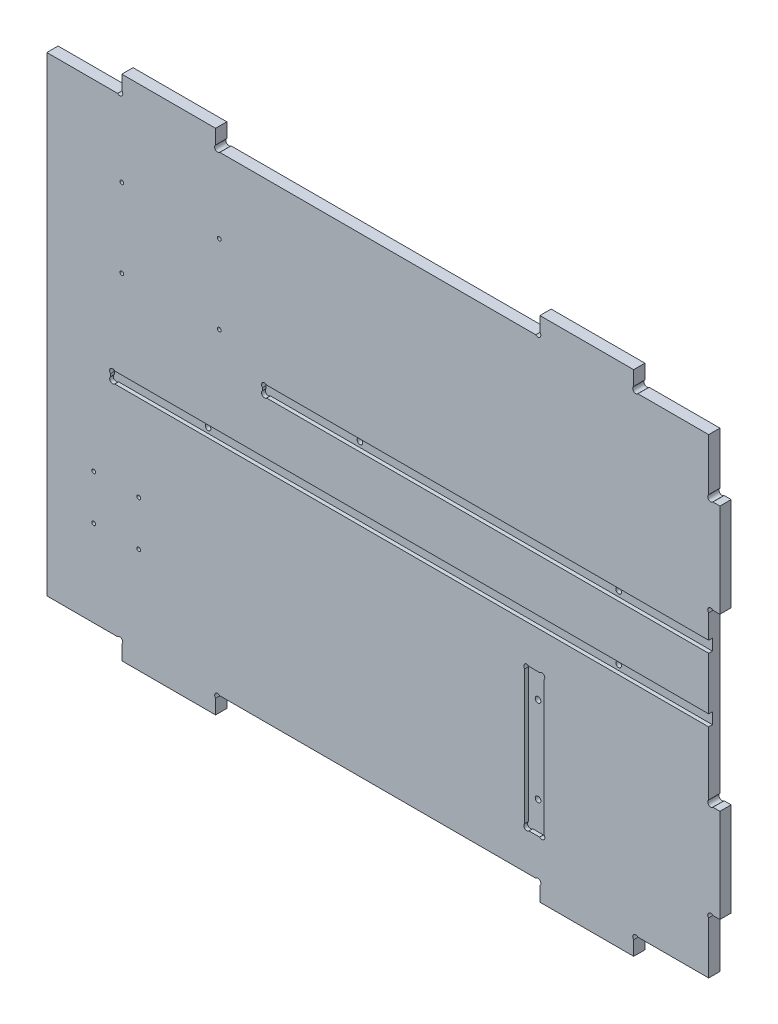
ISO-10303-21;
HEADER;
FILE_DESCRIPTION(('STEP AP214'),'2;1');
FILE_NAME('part.step','',(''),(''),'','','');
FILE_SCHEMA(('AUTOMOTIVE_DESIGN { 1 0 10303 214 1 1 1 1 }'));
ENDSEC;
DATA;
#1=APPLICATION_CONTEXT('core data for automotive mechanical design processes');
#2=APPLICATION_PROTOCOL_DEFINITION('international standard','automotive_design',2000,#1);
#3=PRODUCT_CONTEXT('',#1,'mechanical');
#4=PRODUCT('Part','Part','',(#3));
#5=PRODUCT_RELATED_PRODUCT_CATEGORY('part','',(#4));
#6=PRODUCT_DEFINITION_FORMATION('','',#4);
#7=PRODUCT_DEFINITION_CONTEXT('part definition',#1,'design');
#8=PRODUCT_DEFINITION('design','',#6,#7);
#9=PRODUCT_DEFINITION_SHAPE('','',#8);
#10=(LENGTH_UNIT() NAMED_UNIT(*) SI_UNIT(.MILLI.,.METRE.));
#11=(NAMED_UNIT(*) PLANE_ANGLE_UNIT() SI_UNIT($,.RADIAN.));
#12=(NAMED_UNIT(*) SI_UNIT($,.STERADIAN.) SOLID_ANGLE_UNIT());
#13=UNCERTAINTY_MEASURE_WITH_UNIT(LENGTH_MEASURE(1.E-05),#10,'distance_accuracy_value','');
#14=(GEOMETRIC_REPRESENTATION_CONTEXT(3) GLOBAL_UNCERTAINTY_ASSIGNED_CONTEXT((#13)) GLOBAL_UNIT_ASSIGNED_CONTEXT((#10,
#11,#12)) REPRESENTATION_CONTEXT('',''));
#15=CARTESIAN_POINT('',(0.,0.,0.));
#16=DIRECTION('',(0.,0.,1.));
#17=DIRECTION('',(1.,0.,0.));
#18=AXIS2_PLACEMENT_3D('',#15,#16,#17);
#19=CARTESIAN_POINT('',(-17.8669687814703,38.1255790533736,6.));
#20=DIRECTION('',(0.,-1.,0.));
#21=DIRECTION('',(0.,0.,-1.));
#22=AXIS2_PLACEMENT_3D('',#19,#20,#21);
#23=PLANE('',#22);
#24=DIRECTION('',(-1.,0.,0.));
#25=VECTOR('',#24,1.);
#26=CARTESIAN_POINT('',(-17.8669687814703,38.1255790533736,6.));
#27=LINE('',#26,#25);
#28=CARTESIAN_POINT('',(19.8711362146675,38.1255790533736,6.));
#29=VERTEX_POINT('',#28);
#30=CARTESIAN_POINT('',(-17.8669687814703,38.1255790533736,6.));
#31=VERTEX_POINT('',#30);
#32=EDGE_CURVE('E806',#29,#31,#27,.T.);
#33=ORIENTED_EDGE('',*,*,#32,.F.);
#34=DIRECTION('',(0.,0.,1.));
#35=VECTOR('',#34,1.);
#36=CARTESIAN_POINT('',(19.8711362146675,38.1255790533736,0.));
#37=LINE('',#36,#35);
#38=CARTESIAN_POINT('',(19.8711362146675,38.1255790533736,0.));
#39=VERTEX_POINT('',#38);
#40=EDGE_CURVE('E959',#29,#39,#37,.F.);
#41=ORIENTED_EDGE('',*,*,#40,.T.);
#42=DIRECTION('',(-1.,0.,0.));
#43=VECTOR('',#42,1.);
#44=CARTESIAN_POINT('',(-17.8669687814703,38.1255790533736,0.));
#45=LINE('',#44,#43);
#46=CARTESIAN_POINT('',(-17.8669687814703,38.1255790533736,0.));
#47=VERTEX_POINT('',#46);
#48=EDGE_CURVE('E783',#39,#47,#45,.T.);
#49=ORIENTED_EDGE('',*,*,#48,.T.);
#50=DIRECTION('',(0.,0.,-1.));
#51=VECTOR('',#50,1.);
#52=CARTESIAN_POINT('',(-17.8669687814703,38.1255790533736,6.));
#53=LINE('',#52,#51);
#54=EDGE_CURVE('E798',#31,#47,#53,.T.);
#55=ORIENTED_EDGE('',*,*,#54,.F.);
#56=EDGE_LOOP('',(#33,#41,#49,#55));
#57=FACE_BOUND('',#56,.T.);
#58=ADVANCED_FACE('F32',(#57),#23,.F.);
#59=CARTESIAN_POINT('',(242.871136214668,38.1255790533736,0.));
#60=VERTEX_POINT('',#59);
#61=CARTESIAN_POINT('',(74.394926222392,38.1255790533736,0.));
#62=VERTEX_POINT('',#61);
#63=EDGE_CURVE('E779',#60,#62,#45,.T.);
#64=ORIENTED_EDGE('',*,*,#63,.T.);
#65=DIRECTION('',(0.,0.,1.));
#66=VECTOR('',#65,1.);
#67=CARTESIAN_POINT('',(74.394926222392,38.1255790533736,0.));
#68=LINE('',#67,#66);
#69=CARTESIAN_POINT('',(74.394926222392,38.1255790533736,6.));
#70=VERTEX_POINT('',#69);
#71=EDGE_CURVE('E963',#62,#70,#68,.T.);
#72=ORIENTED_EDGE('',*,*,#71,.T.);
#73=CARTESIAN_POINT('',(242.871136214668,38.1255790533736,6.));
#74=VERTEX_POINT('',#73);
#75=EDGE_CURVE('E422',#74,#70,#27,.T.);
#76=ORIENTED_EDGE('',*,*,#75,.F.);
#77=DIRECTION('',(0.,0.,1.));
#78=VECTOR('',#77,1.);
#79=CARTESIAN_POINT('',(242.871136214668,38.1255790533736,0.));
#80=LINE('',#79,#78);
#81=EDGE_CURVE('E977',#74,#60,#80,.F.);
#82=ORIENTED_EDGE('',*,*,#81,.T.);
#83=EDGE_LOOP('',(#64,#72,#76,#82));
#84=FACE_BOUND('',#83,.T.);
#85=ADVANCED_FACE('F1133',(#84),#23,.F.);
#86=CARTESIAN_POINT('',(335.13303121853,38.1255790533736,0.));
#87=VERTEX_POINT('',#86);
#88=CARTESIAN_POINT('',(297.394926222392,38.1255790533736,0.));
#89=VERTEX_POINT('',#88);
#90=EDGE_CURVE('E782',#87,#89,#45,.T.);
#91=ORIENTED_EDGE('',*,*,#90,.T.);
#92=DIRECTION('',(0.,0.,1.));
#93=VECTOR('',#92,1.);
#94=CARTESIAN_POINT('',(297.394926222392,38.1255790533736,0.));
#95=LINE('',#94,#93);
#96=CARTESIAN_POINT('',(297.394926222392,38.1255790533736,6.));
#97=VERTEX_POINT('',#96);
#98=EDGE_CURVE('E969',#89,#97,#95,.T.);
#99=ORIENTED_EDGE('',*,*,#98,.T.);
#100=CARTESIAN_POINT('',(335.13303121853,38.1255790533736,6.));
#101=VERTEX_POINT('',#100);
#102=EDGE_CURVE('E795',#101,#97,#27,.T.);
#103=ORIENTED_EDGE('',*,*,#102,.F.);
#104=DIRECTION('',(0.,0.,-1.));
#105=VECTOR('',#104,1.);
#106=CARTESIAN_POINT('',(335.13303121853,38.1255790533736,6.));
#107=LINE('',#106,#105);
#108=EDGE_CURVE('E1007',#101,#87,#107,.T.);
#109=ORIENTED_EDGE('',*,*,#108,.T.);
#110=EDGE_LOOP('',(#91,#99,#103,#109));
#111=FACE_BOUND('',#110,.T.);
#112=ADVANCED_FACE('F1136',(#111),#23,.F.);
#113=CARTESIAN_POINT('',(-17.8669687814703,-212.874420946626,6.));
#114=DIRECTION('',(0.,1.,0.));
#115=DIRECTION('',(0.,0.,1.));
#116=AXIS2_PLACEMENT_3D('',#113,#114,#115);
#117=PLANE('',#116);
#118=DIRECTION('',(1.,0.,0.));
#119=VECTOR('',#118,1.);
#120=CARTESIAN_POINT('',(-17.8669687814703,-212.874420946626,6.));
#121=LINE('',#120,#119);
#122=CARTESIAN_POINT('',(297.394926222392,-212.874420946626,6.));
#123=VERTEX_POINT('',#122);
#124=CARTESIAN_POINT('',(335.13303121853,-212.874420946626,6.));
#125=VERTEX_POINT('',#124);
#126=EDGE_CURVE('E769',#123,#125,#121,.T.);
#127=ORIENTED_EDGE('',*,*,#126,.F.);
#128=DIRECTION('',(0.,0.,1.));
#129=VECTOR('',#128,1.);
#130=CARTESIAN_POINT('',(297.394926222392,-212.874420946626,0.));
#131=LINE('',#130,#129);
#132=CARTESIAN_POINT('',(297.394926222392,-212.874420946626,0.));
#133=VERTEX_POINT('',#132);
#134=EDGE_CURVE('E885',#123,#133,#131,.F.);
#135=ORIENTED_EDGE('',*,*,#134,.T.);
#136=DIRECTION('',(1.,0.,0.));
#137=VECTOR('',#136,1.);
#138=CARTESIAN_POINT('',(-17.8669687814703,-212.874420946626,0.));
#139=LINE('',#138,#137);
#140=CARTESIAN_POINT('',(335.13303121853,-212.874420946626,0.));
#141=VERTEX_POINT('',#140);
#142=EDGE_CURVE('E730',#133,#141,#139,.T.);
#143=ORIENTED_EDGE('',*,*,#142,.T.);
#144=DIRECTION('',(0.,0.,-1.));
#145=VECTOR('',#144,1.);
#146=CARTESIAN_POINT('',(335.13303121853,-212.874420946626,6.));
#147=LINE('',#146,#145);
#148=EDGE_CURVE('E1001',#125,#141,#147,.T.);
#149=ORIENTED_EDGE('',*,*,#148,.F.);
#150=EDGE_LOOP('',(#127,#135,#143,#149));
#151=FACE_BOUND('',#150,.T.);
#152=ADVANCED_FACE('F1000',(#151),#117,.F.);
#153=CARTESIAN_POINT('',(74.394926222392,-212.874420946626,0.));
#154=VERTEX_POINT('',#153);
#155=CARTESIAN_POINT('',(242.871136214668,-212.874420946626,0.));
#156=VERTEX_POINT('',#155);
#157=EDGE_CURVE('E738',#154,#156,#139,.T.);
#158=ORIENTED_EDGE('',*,*,#157,.T.);
#159=DIRECTION('',(0.,0.,1.));
#160=VECTOR('',#159,1.);
#161=CARTESIAN_POINT('',(242.871136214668,-212.874420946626,0.));
#162=LINE('',#161,#160);
#163=CARTESIAN_POINT('',(242.871136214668,-212.874420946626,6.));
#164=VERTEX_POINT('',#163);
#165=EDGE_CURVE('E889',#156,#164,#162,.T.);
#166=ORIENTED_EDGE('',*,*,#165,.T.);
#167=CARTESIAN_POINT('',(74.394926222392,-212.874420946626,6.));
#168=VERTEX_POINT('',#167);
#169=EDGE_CURVE('E755',#168,#164,#121,.T.);
#170=ORIENTED_EDGE('',*,*,#169,.F.);
#171=DIRECTION('',(0.,0.,1.));
#172=VECTOR('',#171,1.);
#173=CARTESIAN_POINT('',(74.394926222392,-212.874420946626,0.));
#174=LINE('',#173,#172);
#175=EDGE_CURVE('E897',#168,#154,#174,.F.);
#176=ORIENTED_EDGE('',*,*,#175,.T.);
#177=EDGE_LOOP('',(#158,#166,#170,#176));
#178=FACE_BOUND('',#177,.T.);
#179=ADVANCED_FACE('F989',(#178),#117,.F.);
#180=CARTESIAN_POINT('',(-17.8669687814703,-212.874420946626,0.));
#181=VERTEX_POINT('',#180);
#182=CARTESIAN_POINT('',(19.8711362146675,-212.874420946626,0.));
#183=VERTEX_POINT('',#182);
#184=EDGE_CURVE('E743',#181,#183,#139,.T.);
#185=ORIENTED_EDGE('',*,*,#184,.T.);
#186=DIRECTION('',(0.,0.,1.));
#187=VECTOR('',#186,1.);
#188=CARTESIAN_POINT('',(19.8711362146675,-212.874420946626,0.));
#189=LINE('',#188,#187);
#190=CARTESIAN_POINT('',(19.8711362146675,-212.874420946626,6.));
#191=VERTEX_POINT('',#190);
#192=EDGE_CURVE('E905',#183,#191,#189,.T.);
#193=ORIENTED_EDGE('',*,*,#192,.T.);
#194=CARTESIAN_POINT('',(-17.8669687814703,-212.874420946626,6.));
#195=VERTEX_POINT('',#194);
#196=EDGE_CURVE('E750',#195,#191,#121,.T.);
#197=ORIENTED_EDGE('',*,*,#196,.F.);
#198=DIRECTION('',(0.,0.,-1.));
#199=VECTOR('',#198,1.);
#200=CARTESIAN_POINT('',(-17.8669687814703,-212.874420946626,6.));
#201=LINE('',#200,#199);
#202=EDGE_CURVE('E841',#195,#181,#201,.T.);
#203=ORIENTED_EDGE('',*,*,#202,.T.);
#204=EDGE_LOOP('',(#185,#193,#197,#203));
#205=FACE_BOUND('',#204,.T.);
#206=ADVANCED_FACE('F1149',(#205),#117,.F.);
#207=CARTESIAN_POINT('',(335.13303121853,38.1255790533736,6.));
#208=DIRECTION('',(-1.,0.,0.));
#209=DIRECTION('',(0.,-1.,0.));
#210=AXIS2_PLACEMENT_3D('',#207,#208,#209);
#211=PLANE('',#210);
#212=DIRECTION('',(0.,1.,0.));
#213=VECTOR('',#212,1.);
#214=CARTESIAN_POINT('',(335.13303121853,38.1255790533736,0.));
#215=LINE('',#214,#213);
#216=CARTESIAN_POINT('',(335.13303121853,-185.136315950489,0.));
#217=VERTEX_POINT('',#216);
#218=EDGE_CURVE('E808',#141,#217,#215,.T.);
#219=ORIENTED_EDGE('',*,*,#218,.T.);
#220=DIRECTION('',(0.,0.,1.));
#221=VECTOR('',#220,1.);
#222=CARTESIAN_POINT('',(335.13303121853,-185.136315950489,0.));
#223=LINE('',#222,#221);
#224=CARTESIAN_POINT('',(335.13303121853,-185.136315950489,6.));
#225=VERTEX_POINT('',#224);
#226=EDGE_CURVE('E913',#217,#225,#223,.T.);
#227=ORIENTED_EDGE('',*,*,#226,.T.);
#228=DIRECTION('',(0.,1.,0.));
#229=VECTOR('',#228,1.);
#230=CARTESIAN_POINT('',(335.13303121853,38.1255790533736,6.));
#231=LINE('',#230,#229);
#232=EDGE_CURVE('E762',#125,#225,#231,.T.);
#233=ORIENTED_EDGE('',*,*,#232,.F.);
#234=ORIENTED_EDGE('',*,*,#148,.T.);
#235=EDGE_LOOP('',(#219,#227,#233,#234));
#236=FACE_BOUND('',#235,.T.);
#237=ADVANCED_FACE('F1005',(#236),#211,.F.);
#238=CARTESIAN_POINT('',(335.13303121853,-130.612525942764,6.));
#239=VERTEX_POINT('',#238);
#240=CARTESIAN_POINT('',(335.13303121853,-96.8744209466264,6.));
#241=VERTEX_POINT('',#240);
#242=EDGE_CURVE('E1082',#239,#241,#231,.T.);
#243=ORIENTED_EDGE('',*,*,#242,.F.);
#244=DIRECTION('',(0.,0.,1.));
#245=VECTOR('',#244,1.);
#246=CARTESIAN_POINT('',(335.13303121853,-130.612525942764,0.));
#247=LINE('',#246,#245);
#248=CARTESIAN_POINT('',(335.13303121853,-130.612525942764,0.));
#249=VERTEX_POINT('',#248);
#250=EDGE_CURVE('E921',#239,#249,#247,.F.);
#251=ORIENTED_EDGE('',*,*,#250,.T.);
#252=CARTESIAN_POINT('',(335.13303121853,-44.1363159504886,0.));
#253=VERTEX_POINT('',#252);
#254=EDGE_CURVE('E843',#249,#253,#215,.T.);
#255=ORIENTED_EDGE('',*,*,#254,.T.);
#256=DIRECTION('',(0.,0.,1.));
#257=VECTOR('',#256,1.);
#258=CARTESIAN_POINT('',(335.13303121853,-44.1363159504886,0.));
#259=LINE('',#258,#257);
#260=CARTESIAN_POINT('',(335.13303121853,-44.1363159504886,6.));
#261=VERTEX_POINT('',#260);
#262=EDGE_CURVE('E929',#253,#261,#259,.T.);
#263=ORIENTED_EDGE('',*,*,#262,.T.);
#264=CARTESIAN_POINT('',(335.13303121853,-56.8744209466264,6.));
#265=VERTEX_POINT('',#264);
#266=EDGE_CURVE('E845',#265,#261,#231,.T.);
#267=ORIENTED_EDGE('',*,*,#266,.F.);
#268=DIRECTION('',(0.,0.,1.));
#269=VECTOR('',#268,1.);
#270=CARTESIAN_POINT('',(335.13303121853,-56.8744209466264,4.));
#271=LINE('',#270,#269);
#272=CARTESIAN_POINT('',(335.13303121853,-56.8744209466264,4.));
#273=VERTEX_POINT('',#272);
#274=EDGE_CURVE('E702',#273,#265,#271,.T.);
#275=ORIENTED_EDGE('',*,*,#274,.F.);
#276=DIRECTION('',(0.,1.,0.));
#277=VECTOR('',#276,1.);
#278=CARTESIAN_POINT('',(335.13303121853,-56.8744209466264,4.));
#279=LINE('',#278,#277);
#280=CARTESIAN_POINT('',(335.13303121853,-62.8744209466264,4.));
#281=VERTEX_POINT('',#280);
#282=EDGE_CURVE('E691',#281,#273,#279,.T.);
#283=ORIENTED_EDGE('',*,*,#282,.F.);
#284=DIRECTION('',(0.,0.,1.));
#285=VECTOR('',#284,1.);
#286=CARTESIAN_POINT('',(335.13303121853,-62.8744209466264,4.));
#287=LINE('',#286,#285);
#288=CARTESIAN_POINT('',(335.13303121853,-62.8744209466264,6.));
#289=VERTEX_POINT('',#288);
#290=EDGE_CURVE('E703',#281,#289,#287,.T.);
#291=ORIENTED_EDGE('',*,*,#290,.T.);
#292=CARTESIAN_POINT('',(335.13303121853,-90.8744209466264,6.));
#293=VERTEX_POINT('',#292);
#294=EDGE_CURVE('E1014',#293,#289,#231,.T.);
#295=ORIENTED_EDGE('',*,*,#294,.F.);
#296=DIRECTION('',(0.,0.,1.));
#297=VECTOR('',#296,1.);
#298=CARTESIAN_POINT('',(335.13303121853,-90.8744209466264,4.));
#299=LINE('',#298,#297);
#300=CARTESIAN_POINT('',(335.13303121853,-90.8744209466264,4.));
#301=VERTEX_POINT('',#300);
#302=EDGE_CURVE('E678',#301,#293,#299,.T.);
#303=ORIENTED_EDGE('',*,*,#302,.F.);
#304=DIRECTION('',(0.,1.,0.));
#305=VECTOR('',#304,1.);
#306=CARTESIAN_POINT('',(335.13303121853,-90.8744209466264,4.));
#307=LINE('',#306,#305);
#308=CARTESIAN_POINT('',(335.13303121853,-96.8744209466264,4.));
#309=VERTEX_POINT('',#308);
#310=EDGE_CURVE('E667',#309,#301,#307,.T.);
#311=ORIENTED_EDGE('',*,*,#310,.F.);
#312=DIRECTION('',(0.,0.,1.));
#313=VECTOR('',#312,1.);
#314=CARTESIAN_POINT('',(335.13303121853,-96.8744209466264,4.));
#315=LINE('',#314,#313);
#316=EDGE_CURVE('E679',#309,#241,#315,.T.);
#317=ORIENTED_EDGE('',*,*,#316,.T.);
#318=EDGE_LOOP('',(#243,#251,#255,#263,#267,#275,#283,#291,#295,#303,#311,#317));
#319=FACE_BOUND('',#318,.T.);
#320=ADVANCED_FACE('F1060',(#319),#211,.F.);
#321=CARTESIAN_POINT('',(335.13303121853,10.3874740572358,6.));
#322=VERTEX_POINT('',#321);
#323=EDGE_CURVE('E754',#322,#101,#231,.T.);
#324=ORIENTED_EDGE('',*,*,#323,.F.);
#325=DIRECTION('',(0.,0.,1.));
#326=VECTOR('',#325,1.);
#327=CARTESIAN_POINT('',(335.13303121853,10.3874740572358,0.));
#328=LINE('',#327,#326);
#329=CARTESIAN_POINT('',(335.13303121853,10.3874740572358,0.));
#330=VERTEX_POINT('',#329);
#331=EDGE_CURVE('E937',#322,#330,#328,.F.);
#332=ORIENTED_EDGE('',*,*,#331,.T.);
#333=EDGE_CURVE('E747',#330,#87,#215,.T.);
#334=ORIENTED_EDGE('',*,*,#333,.T.);
#335=ORIENTED_EDGE('',*,*,#108,.F.);
#336=EDGE_LOOP('',(#324,#332,#334,#335));
#337=FACE_BOUND('',#336,.T.);
#338=ADVANCED_FACE('F1041',(#337),#211,.F.);
#339=CARTESIAN_POINT('',(-17.8669687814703,38.1255790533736,6.));
#340=DIRECTION('',(1.,0.,0.));
#341=DIRECTION('',(0.,1.,0.));
#342=AXIS2_PLACEMENT_3D('',#339,#340,#341);
#343=PLANE('',#342);
#344=DIRECTION('',(0.,-1.,0.));
#345=VECTOR('',#344,1.);
#346=CARTESIAN_POINT('',(-17.8669687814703,38.1255790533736,0.));
#347=LINE('',#346,#345);
#348=EDGE_CURVE('E727',#47,#181,#347,.T.);
#349=ORIENTED_EDGE('',*,*,#348,.T.);
#350=ORIENTED_EDGE('',*,*,#202,.F.);
#351=DIRECTION('',(0.,-1.,0.));
#352=VECTOR('',#351,1.);
#353=CARTESIAN_POINT('',(-17.8669687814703,38.1255790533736,6.));
#354=LINE('',#353,#352);
#355=EDGE_CURVE('E761',#31,#195,#354,.T.);
#356=ORIENTED_EDGE('',*,*,#355,.F.);
#357=ORIENTED_EDGE('',*,*,#54,.T.);
#358=EDGE_LOOP('',(#349,#350,#356,#357));
#359=FACE_BOUND('',#358,.T.);
#360=ADVANCED_FACE('F34',(#359),#343,.F.);
#361=CARTESIAN_POINT('',(-17.8669687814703,-212.874420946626,6.));
#362=DIRECTION('',(0.,0.,1.));
#363=DIRECTION('',(1.,0.,0.));
#364=AXIS2_PLACEMENT_3D('',#361,#362,#363);
#365=PLANE('',#364);
#366=CARTESIAN_POINT('',(74.1330312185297,-43.8744209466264,6.));
#367=DIRECTION('',(0.,0.,1.));
#368=DIRECTION('',(1.,0.,0.));
#369=AXIS2_PLACEMENT_3D('',#366,#367,#368);
#370=CIRCLE('',#369,0.999999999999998);
#371=CARTESIAN_POINT('',(75.1330312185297,-43.8744209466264,6.));
#372=VERTEX_POINT('',#371);
#373=EDGE_CURVE('E1439',#372,#372,#370,.T.);
#374=ORIENTED_EDGE('',*,*,#373,.F.);
#375=EDGE_LOOP('',(#374));
#376=FACE_BOUND('',#375,.T.);
#377=CARTESIAN_POINT('',(74.1330312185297,-1.87442094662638,6.));
#378=DIRECTION('',(0.,0.,1.));
#379=DIRECTION('',(1.,0.,0.));
#380=AXIS2_PLACEMENT_3D('',#377,#378,#379);
#381=CIRCLE('',#380,0.999999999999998);
#382=CARTESIAN_POINT('',(75.1330312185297,-1.87442094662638,6.));
#383=VERTEX_POINT('',#382);
#384=EDGE_CURVE('E1441',#383,#383,#381,.T.);
#385=ORIENTED_EDGE('',*,*,#384,.F.);
#386=EDGE_LOOP('',(#385));
#387=FACE_BOUND('',#386,.T.);
#388=CARTESIAN_POINT('',(22.1330312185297,-1.87442094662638,6.));
#389=DIRECTION('',(0.,0.,1.));
#390=DIRECTION('',(1.,0.,0.));
#391=AXIS2_PLACEMENT_3D('',#388,#389,#390);
#392=CIRCLE('',#391,1.);
#393=CARTESIAN_POINT('',(23.1330312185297,-1.87442094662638,6.));
#394=VERTEX_POINT('',#393);
#395=EDGE_CURVE('E1449',#394,#394,#392,.T.);
#396=ORIENTED_EDGE('',*,*,#395,.F.);
#397=EDGE_LOOP('',(#396));
#398=FACE_BOUND('',#397,.T.);
#399=CARTESIAN_POINT('',(22.1330312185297,-43.8744209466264,6.));
#400=DIRECTION('',(0.,0.,1.));
#401=DIRECTION('',(1.,0.,0.));
#402=AXIS2_PLACEMENT_3D('',#399,#400,#401);
#403=CIRCLE('',#402,1.);
#404=CARTESIAN_POINT('',(23.1330312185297,-43.8744209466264,6.));
#405=VERTEX_POINT('',#404);
#406=EDGE_CURVE('E1455',#405,#405,#403,.T.);
#407=ORIENTED_EDGE('',*,*,#406,.F.);
#408=EDGE_LOOP('',(#407));
#409=FACE_BOUND('',#408,.T.);
#410=CARTESIAN_POINT('',(73.2330312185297,39.2255790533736,6.));
#411=DIRECTION('',(0.,0.,1.));
#412=DIRECTION('',(1.,0.,0.));
#413=AXIS2_PLACEMENT_3D('',#410,#411,#412);
#414=CIRCLE('',#413,1.60000000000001);
#415=CARTESIAN_POINT('',(72.1330312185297,40.3874740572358,6.));
#416=VERTEX_POINT('',#415);
#417=EDGE_CURVE('E407',#416,#70,#414,.T.);
#418=ORIENTED_EDGE('',*,*,#417,.F.);
#419=DIRECTION('',(0.,-1.,0.));
#420=VECTOR('',#419,1.);
#421=CARTESIAN_POINT('',(72.1330312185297,48.1255790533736,5.99999999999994));
#422=LINE('',#421,#420);
#423=CARTESIAN_POINT('',(72.1330312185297,48.1255790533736,5.99999999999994));
#424=VERTEX_POINT('',#423);
#425=EDGE_CURVE('E418',#424,#416,#422,.T.);
#426=ORIENTED_EDGE('',*,*,#425,.F.);
#427=DIRECTION('',(1.,0.,0.));
#428=VECTOR('',#427,1.);
#429=CARTESIAN_POINT('',(22.1330312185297,48.1255790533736,6.));
#430=LINE('',#429,#428);
#431=CARTESIAN_POINT('',(22.1330312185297,48.1255790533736,6.));
#432=VERTEX_POINT('',#431);
#433=EDGE_CURVE('E943',#432,#424,#430,.T.);
#434=ORIENTED_EDGE('',*,*,#433,.F.);
#435=DIRECTION('',(0.,-1.,0.));
#436=VECTOR('',#435,1.);
#437=CARTESIAN_POINT('',(22.1330312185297,48.1255790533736,6.));
#438=LINE('',#437,#436);
#439=CARTESIAN_POINT('',(22.1330312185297,40.3874740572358,6.));
#440=VERTEX_POINT('',#439);
#441=EDGE_CURVE('E427',#432,#440,#438,.T.);
#442=ORIENTED_EDGE('',*,*,#441,.T.);
#443=CARTESIAN_POINT('',(21.0330312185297,39.2255790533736,6.));
#444=DIRECTION('',(0.,0.,1.));
#445=DIRECTION('',(1.,0.,0.));
#446=AXIS2_PLACEMENT_3D('',#443,#444,#445);
#447=CIRCLE('',#446,1.6);
#448=EDGE_CURVE('E54',#29,#440,#447,.T.);
#449=ORIENTED_EDGE('',*,*,#448,.F.);
#450=ORIENTED_EDGE('',*,*,#32,.T.);
#451=ORIENTED_EDGE('',*,*,#355,.T.);
#452=ORIENTED_EDGE('',*,*,#196,.T.);
#453=CARTESIAN_POINT('',(21.0330312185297,-213.974420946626,6.));
#454=DIRECTION('',(0.,0.,1.));
#455=DIRECTION('',(1.,0.,0.));
#456=AXIS2_PLACEMENT_3D('',#453,#454,#455);
#457=CIRCLE('',#456,1.59999999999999);
#458=CARTESIAN_POINT('',(22.1330312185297,-215.136315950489,6.));
#459=VERTEX_POINT('',#458);
#460=EDGE_CURVE('E900',#459,#191,#457,.T.);
#461=ORIENTED_EDGE('',*,*,#460,.F.);
#462=DIRECTION('',(0.,1.,0.));
#463=VECTOR('',#462,1.);
#464=CARTESIAN_POINT('',(22.1330312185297,-222.874420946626,6.));
#465=LINE('',#464,#463);
#466=CARTESIAN_POINT('',(22.1330312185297,-222.874420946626,6.));
#467=VERTEX_POINT('',#466);
#468=EDGE_CURVE('E477',#467,#459,#465,.T.);
#469=ORIENTED_EDGE('',*,*,#468,.F.);
#470=DIRECTION('',(-1.,0.,0.));
#471=VECTOR('',#470,1.);
#472=CARTESIAN_POINT('',(22.1330312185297,-222.874420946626,6.));
#473=LINE('',#472,#471);
#474=CARTESIAN_POINT('',(72.1330312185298,-222.874420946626,6.));
#475=VERTEX_POINT('',#474);
#476=EDGE_CURVE('E475',#475,#467,#473,.T.);
#477=ORIENTED_EDGE('',*,*,#476,.F.);
#478=DIRECTION('',(0.,1.,0.));
#479=VECTOR('',#478,1.);
#480=CARTESIAN_POINT('',(72.1330312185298,-222.874420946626,6.));
#481=LINE('',#480,#479);
#482=CARTESIAN_POINT('',(72.1330312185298,-215.136315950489,6.));
#483=VERTEX_POINT('',#482);
#484=EDGE_CURVE('E756',#475,#483,#481,.T.);
#485=ORIENTED_EDGE('',*,*,#484,.T.);
#486=CARTESIAN_POINT('',(73.2330312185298,-213.974420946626,6.));
#487=DIRECTION('',(0.,0.,1.));
#488=DIRECTION('',(1.,0.,0.));
#489=AXIS2_PLACEMENT_3D('',#486,#487,#488);
#490=CIRCLE('',#489,1.6);
#491=EDGE_CURVE('E887',#168,#483,#490,.T.);
#492=ORIENTED_EDGE('',*,*,#491,.F.);
#493=ORIENTED_EDGE('',*,*,#169,.T.);
#494=CARTESIAN_POINT('',(244.03303121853,-213.974420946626,6.));
#495=DIRECTION('',(0.,0.,1.));
#496=DIRECTION('',(1.,0.,0.));
#497=AXIS2_PLACEMENT_3D('',#494,#495,#496);
#498=CIRCLE('',#497,1.59999999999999);
#499=CARTESIAN_POINT('',(245.13303121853,-215.136315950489,6.));
#500=VERTEX_POINT('',#499);
#501=EDGE_CURVE('E980',#500,#164,#498,.T.);
#502=ORIENTED_EDGE('',*,*,#501,.F.);
#503=DIRECTION('',(0.,1.,0.));
#504=VECTOR('',#503,1.);
#505=CARTESIAN_POINT('',(245.13303121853,-222.874420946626,5.99999999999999));
#506=LINE('',#505,#504);
#507=CARTESIAN_POINT('',(245.13303121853,-222.874420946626,5.99999999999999));
#508=VERTEX_POINT('',#507);
#509=EDGE_CURVE('E462',#508,#500,#506,.T.);
#510=ORIENTED_EDGE('',*,*,#509,.F.);
#511=DIRECTION('',(-1.,0.,0.));
#512=VECTOR('',#511,1.);
#513=CARTESIAN_POINT('',(295.13303121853,-222.874420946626,6.));
#514=LINE('',#513,#512);
#515=CARTESIAN_POINT('',(295.13303121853,-222.874420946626,6.));
#516=VERTEX_POINT('',#515);
#517=EDGE_CURVE('E449',#516,#508,#514,.T.);
#518=ORIENTED_EDGE('',*,*,#517,.F.);
#519=DIRECTION('',(0.,1.,0.));
#520=VECTOR('',#519,1.);
#521=CARTESIAN_POINT('',(295.13303121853,-222.874420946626,6.));
#522=LINE('',#521,#520);
#523=CARTESIAN_POINT('',(295.13303121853,-215.136315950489,6.));
#524=VERTEX_POINT('',#523);
#525=EDGE_CURVE('E465',#516,#524,#522,.T.);
#526=ORIENTED_EDGE('',*,*,#525,.T.);
#527=CARTESIAN_POINT('',(296.23303121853,-213.974420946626,6.));
#528=DIRECTION('',(0.,0.,1.));
#529=DIRECTION('',(1.,0.,0.));
#530=AXIS2_PLACEMENT_3D('',#527,#528,#529);
#531=CIRCLE('',#530,1.59999999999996);
#532=EDGE_CURVE('E872',#123,#524,#531,.T.);
#533=ORIENTED_EDGE('',*,*,#532,.F.);
#534=ORIENTED_EDGE('',*,*,#126,.T.);
#535=ORIENTED_EDGE('',*,*,#232,.T.);
#536=CARTESIAN_POINT('',(336.23303121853,-183.974420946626,6.));
#537=DIRECTION('',(0.,0.,1.));
#538=DIRECTION('',(1.,0.,0.));
#539=AXIS2_PLACEMENT_3D('',#536,#537,#538);
#540=CIRCLE('',#539,1.59999999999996);
#541=CARTESIAN_POINT('',(337.394926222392,-182.874420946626,6.));
#542=VERTEX_POINT('',#541);
#543=EDGE_CURVE('E908',#542,#225,#540,.T.);
#544=ORIENTED_EDGE('',*,*,#543,.F.);
#545=DIRECTION('',(-1.,0.,0.));
#546=VECTOR('',#545,1.);
#547=CARTESIAN_POINT('',(341.13303121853,-182.874420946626,6.));
#548=LINE('',#547,#546);
#549=CARTESIAN_POINT('',(341.13303121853,-182.874420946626,6.));
#550=VERTEX_POINT('',#549);
#551=EDGE_CURVE('E497',#550,#542,#548,.T.);
#552=ORIENTED_EDGE('',*,*,#551,.F.);
#553=DIRECTION('',(0.,-1.,0.));
#554=VECTOR('',#553,1.);
#555=CARTESIAN_POINT('',(341.13303121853,-182.874420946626,6.));
#556=LINE('',#555,#554);
#557=CARTESIAN_POINT('',(341.13303121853,-132.874420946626,6.));
#558=VERTEX_POINT('',#557);
#559=EDGE_CURVE('E478',#558,#550,#556,.T.);
#560=ORIENTED_EDGE('',*,*,#559,.F.);
#561=DIRECTION('',(-1.,0.,0.));
#562=VECTOR('',#561,1.);
#563=CARTESIAN_POINT('',(341.13303121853,-132.874420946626,6.));
#564=LINE('',#563,#562);
#565=CARTESIAN_POINT('',(337.394926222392,-132.874420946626,6.));
#566=VERTEX_POINT('',#565);
#567=EDGE_CURVE('E488',#558,#566,#564,.T.);
#568=ORIENTED_EDGE('',*,*,#567,.T.);
#569=CARTESIAN_POINT('',(336.23303121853,-131.774420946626,6.));
#570=DIRECTION('',(0.,0.,1.));
#571=DIRECTION('',(1.,0.,0.));
#572=AXIS2_PLACEMENT_3D('',#569,#570,#571);
#573=CIRCLE('',#572,1.59999999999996);
#574=EDGE_CURVE('E916',#239,#566,#573,.T.);
#575=ORIENTED_EDGE('',*,*,#574,.F.);
#576=ORIENTED_EDGE('',*,*,#242,.T.);
#577=DIRECTION('',(1.,0.,0.));
#578=VECTOR('',#577,1.);
#579=CARTESIAN_POINT('',(335.13303121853,-96.8744209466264,6.));
#580=LINE('',#579,#578);
#581=CARTESIAN_POINT('',(18.394926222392,-96.8744209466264,6.));
#582=VERTEX_POINT('',#581);
#583=EDGE_CURVE('E664',#582,#241,#580,.T.);
#584=ORIENTED_EDGE('',*,*,#583,.F.);
#585=CARTESIAN_POINT('',(17.2330312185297,-95.7744209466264,6.));
#586=DIRECTION('',(0.,0.,1.));
#587=DIRECTION('',(1.,0.,0.));
#588=AXIS2_PLACEMENT_3D('',#585,#586,#587);
#589=CIRCLE('',#588,1.60000000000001);
#590=CARTESIAN_POINT('',(16.1330312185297,-94.6125259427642,6.));
#591=VERTEX_POINT('',#590);
#592=EDGE_CURVE('E510',#591,#582,#589,.T.);
#593=ORIENTED_EDGE('',*,*,#592,.F.);
#594=DIRECTION('',(0.,-1.,0.));
#595=VECTOR('',#594,1.);
#596=CARTESIAN_POINT('',(16.1330312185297,-90.8744209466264,6.));
#597=LINE('',#596,#595);
#598=CARTESIAN_POINT('',(16.1330312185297,-93.1363159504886,6.));
#599=VERTEX_POINT('',#598);
#600=EDGE_CURVE('E661',#599,#591,#597,.T.);
#601=ORIENTED_EDGE('',*,*,#600,.F.);
#602=CARTESIAN_POINT('',(17.2330312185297,-91.9744209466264,6.));
#603=DIRECTION('',(0.,0.,1.));
#604=DIRECTION('',(1.,0.,0.));
#605=AXIS2_PLACEMENT_3D('',#602,#603,#604);
#606=CIRCLE('',#605,1.60000000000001);
#607=CARTESIAN_POINT('',(18.394926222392,-90.8744209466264,6.));
#608=VERTEX_POINT('',#607);
#609=EDGE_CURVE('E522',#608,#599,#606,.T.);
#610=ORIENTED_EDGE('',*,*,#609,.F.);
#611=DIRECTION('',(-1.,0.,0.));
#612=VECTOR('',#611,1.);
#613=CARTESIAN_POINT('',(335.13303121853,-90.8744209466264,6.));
#614=LINE('',#613,#612);
#615=EDGE_CURVE('E658',#293,#608,#614,.T.);
#616=ORIENTED_EDGE('',*,*,#615,.F.);
#617=ORIENTED_EDGE('',*,*,#294,.T.);
#618=DIRECTION('',(1.,0.,0.));
#619=VECTOR('',#618,1.);
#620=CARTESIAN_POINT('',(335.13303121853,-62.8744209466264,6.));
#621=LINE('',#620,#619);
#622=CARTESIAN_POINT('',(99.394926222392,-62.8744209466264,6.));
#623=VERTEX_POINT('',#622);
#624=EDGE_CURVE('E689',#623,#289,#621,.T.);
#625=ORIENTED_EDGE('',*,*,#624,.F.);
#626=CARTESIAN_POINT('',(98.2330312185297,-61.7744209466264,6.));
#627=DIRECTION('',(0.,0.,1.));
#628=DIRECTION('',(1.,0.,0.));
#629=AXIS2_PLACEMENT_3D('',#626,#627,#628);
#630=CIRCLE('',#629,1.60000000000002);
#631=CARTESIAN_POINT('',(97.1330312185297,-60.6125259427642,6.));
#632=VERTEX_POINT('',#631);
#633=EDGE_CURVE('E533',#632,#623,#630,.T.);
#634=ORIENTED_EDGE('',*,*,#633,.F.);
#635=DIRECTION('',(0.,-1.,0.));
#636=VECTOR('',#635,1.);
#637=CARTESIAN_POINT('',(97.1330312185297,-56.8744209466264,6.));
#638=LINE('',#637,#636);
#639=CARTESIAN_POINT('',(97.1330312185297,-59.1363159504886,6.));
#640=VERTEX_POINT('',#639);
#641=EDGE_CURVE('E686',#640,#632,#638,.T.);
#642=ORIENTED_EDGE('',*,*,#641,.F.);
#643=CARTESIAN_POINT('',(98.2330312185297,-57.9744209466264,6.));
#644=DIRECTION('',(0.,0.,1.));
#645=DIRECTION('',(1.,0.,0.));
#646=AXIS2_PLACEMENT_3D('',#643,#644,#645);
#647=CIRCLE('',#646,1.60000000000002);
#648=CARTESIAN_POINT('',(99.394926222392,-56.8744209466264,6.));
#649=VERTEX_POINT('',#648);
#650=EDGE_CURVE('E544',#649,#640,#647,.T.);
#651=ORIENTED_EDGE('',*,*,#650,.F.);
#652=DIRECTION('',(-1.,0.,0.));
#653=VECTOR('',#652,1.);
#654=CARTESIAN_POINT('',(335.13303121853,-56.8744209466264,6.));
#655=LINE('',#654,#653);
#656=EDGE_CURVE('E682',#265,#649,#655,.T.);
#657=ORIENTED_EDGE('',*,*,#656,.F.);
#658=ORIENTED_EDGE('',*,*,#266,.T.);
#659=CARTESIAN_POINT('',(336.23303121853,-42.9744209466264,6.));
#660=DIRECTION('',(0.,0.,1.));
#661=DIRECTION('',(1.,0.,0.));
#662=AXIS2_PLACEMENT_3D('',#659,#660,#661);
#663=CIRCLE('',#662,1.59999999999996);
#664=CARTESIAN_POINT('',(337.394926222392,-41.8744209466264,6.));
#665=VERTEX_POINT('',#664);
#666=EDGE_CURVE('E924',#665,#261,#663,.T.);
#667=ORIENTED_EDGE('',*,*,#666,.F.);
#668=DIRECTION('',(-1.,0.,0.));
#669=VECTOR('',#668,1.);
#670=CARTESIAN_POINT('',(341.13303121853,-41.8744209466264,5.99999999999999));
#671=LINE('',#670,#669);
#672=CARTESIAN_POINT('',(341.13303121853,-41.8744209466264,5.99999999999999));
#673=VERTEX_POINT('',#672);
#674=EDGE_CURVE('E513',#673,#665,#671,.T.);
#675=ORIENTED_EDGE('',*,*,#674,.F.);
#676=DIRECTION('',(0.,-1.,0.));
#677=VECTOR('',#676,1.);
#678=CARTESIAN_POINT('',(341.13303121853,8.12557905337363,6.));
#679=LINE('',#678,#677);
#680=CARTESIAN_POINT('',(341.13303121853,8.12557905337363,6.));
#681=VERTEX_POINT('',#680);
#682=EDGE_CURVE('E500',#681,#673,#679,.T.);
#683=ORIENTED_EDGE('',*,*,#682,.F.);
#684=DIRECTION('',(-1.,0.,0.));
#685=VECTOR('',#684,1.);
#686=CARTESIAN_POINT('',(341.13303121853,8.12557905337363,6.));
#687=LINE('',#686,#685);
#688=CARTESIAN_POINT('',(337.394926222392,8.12557905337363,6.));
#689=VERTEX_POINT('',#688);
#690=EDGE_CURVE('E509',#681,#689,#687,.T.);
#691=ORIENTED_EDGE('',*,*,#690,.T.);
#692=CARTESIAN_POINT('',(336.23303121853,9.22557905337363,6.));
#693=DIRECTION('',(0.,0.,1.));
#694=DIRECTION('',(1.,0.,0.));
#695=AXIS2_PLACEMENT_3D('',#692,#693,#694);
#696=CIRCLE('',#695,1.59999999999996);
#697=EDGE_CURVE('E932',#322,#689,#696,.T.);
#698=ORIENTED_EDGE('',*,*,#697,.F.);
#699=ORIENTED_EDGE('',*,*,#323,.T.);
#700=ORIENTED_EDGE('',*,*,#102,.T.);
#701=CARTESIAN_POINT('',(296.23303121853,39.2255790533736,6.));
#702=DIRECTION('',(0.,0.,1.));
#703=DIRECTION('',(1.,0.,0.));
#704=AXIS2_PLACEMENT_3D('',#701,#702,#703);
#705=CIRCLE('',#704,1.59999999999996);
#706=CARTESIAN_POINT('',(295.13303121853,40.3874740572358,6.));
#707=VERTEX_POINT('',#706);
#708=EDGE_CURVE('E961',#707,#97,#705,.T.);
#709=ORIENTED_EDGE('',*,*,#708,.F.);
#710=DIRECTION('',(0.,-1.,0.));
#711=VECTOR('',#710,1.);
#712=CARTESIAN_POINT('',(295.13303121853,48.1255790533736,6.));
#713=LINE('',#712,#711);
#714=CARTESIAN_POINT('',(295.13303121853,48.1255790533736,6.));
#715=VERTEX_POINT('',#714);
#716=EDGE_CURVE('E445',#715,#707,#713,.T.);
#717=ORIENTED_EDGE('',*,*,#716,.F.);
#718=DIRECTION('',(1.,0.,0.));
#719=VECTOR('',#718,1.);
#720=CARTESIAN_POINT('',(295.13303121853,48.1255790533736,6.));
#721=LINE('',#720,#719);
#722=CARTESIAN_POINT('',(245.13303121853,48.1255790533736,6.));
#723=VERTEX_POINT('',#722);
#724=EDGE_CURVE('E443',#723,#715,#721,.T.);
#725=ORIENTED_EDGE('',*,*,#724,.F.);
#726=DIRECTION('',(0.,-1.,0.));
#727=VECTOR('',#726,1.);
#728=CARTESIAN_POINT('',(245.13303121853,48.1255790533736,6.));
#729=LINE('',#728,#727);
#730=CARTESIAN_POINT('',(245.13303121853,40.3874740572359,6.));
#731=VERTEX_POINT('',#730);
#732=EDGE_CURVE('E799',#723,#731,#729,.T.);
#733=ORIENTED_EDGE('',*,*,#732,.T.);
#734=CARTESIAN_POINT('',(244.03303121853,39.2255790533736,6.));
#735=DIRECTION('',(0.,0.,1.));
#736=DIRECTION('',(1.,0.,0.));
#737=AXIS2_PLACEMENT_3D('',#734,#735,#736);
#738=CIRCLE('',#737,1.59999999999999);
#739=EDGE_CURVE('E972',#74,#731,#738,.T.);
#740=ORIENTED_EDGE('',*,*,#739,.F.);
#741=ORIENTED_EDGE('',*,*,#75,.T.);
#742=EDGE_LOOP('',(#418,#426,#434,#442,#449,#450,#451,#452,#461,#469,#477,#485,#492,#493,#502,
#510,#518,#526,#533,#534,#535,#544,#552,#560,#568,#575,#576,#584,#593,#601,#610,#616,#617,#625,
#634,#642,#651,#657,#658,#667,#675,#683,#691,#698,#699,#700,#709,#717,#725,#733,#740,#741));
#743=FACE_BOUND('',#742,.T.);
#744=CARTESIAN_POINT('',(238.13303121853,-191.774420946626,6.));
#745=DIRECTION('',(0.,0.,1.));
#746=DIRECTION('',(1.,0.,0.));
#747=AXIS2_PLACEMENT_3D('',#744,#745,#746);
#748=CIRCLE('',#747,1.59999999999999);
#749=CARTESIAN_POINT('',(237.03303121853,-190.612525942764,6.));
#750=VERTEX_POINT('',#749);
#751=CARTESIAN_POINT('',(239.294926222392,-192.874420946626,6.));
#752=VERTEX_POINT('',#751);
#753=EDGE_CURVE('E555',#750,#752,#748,.T.);
#754=ORIENTED_EDGE('',*,*,#753,.F.);
#755=DIRECTION('',(0.,-1.,0.));
#756=VECTOR('',#755,1.);
#757=CARTESIAN_POINT('',(237.03303121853,-116.874420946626,6.));
#758=LINE('',#757,#756);
#759=CARTESIAN_POINT('',(237.03303121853,-119.136315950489,6.));
#760=VERTEX_POINT('',#759);
#761=EDGE_CURVE('E712',#760,#750,#758,.T.);
#762=ORIENTED_EDGE('',*,*,#761,.F.);
#763=CARTESIAN_POINT('',(238.13303121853,-117.974420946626,6.));
#764=DIRECTION('',(0.,0.,1.));
#765=DIRECTION('',(1.,0.,0.));
#766=AXIS2_PLACEMENT_3D('',#763,#764,#765);
#767=CIRCLE('',#766,1.59999999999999);
#768=CARTESIAN_POINT('',(239.294926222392,-116.874420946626,6.));
#769=VERTEX_POINT('',#768);
#770=EDGE_CURVE('E577',#769,#760,#767,.T.);
#771=ORIENTED_EDGE('',*,*,#770,.F.);
#772=DIRECTION('',(-1.,0.,0.));
#773=VECTOR('',#772,1.);
#774=CARTESIAN_POINT('',(247.23303121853,-116.874420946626,6.));
#775=LINE('',#774,#773);
#776=CARTESIAN_POINT('',(244.971136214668,-116.874420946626,6.));
#777=VERTEX_POINT('',#776);
#778=EDGE_CURVE('E709',#777,#769,#775,.T.);
#779=ORIENTED_EDGE('',*,*,#778,.F.);
#780=CARTESIAN_POINT('',(246.13303121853,-117.974420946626,6.));
#781=DIRECTION('',(0.,0.,1.));
#782=DIRECTION('',(1.,0.,0.));
#783=AXIS2_PLACEMENT_3D('',#780,#781,#782);
#784=CIRCLE('',#783,1.59999999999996);
#785=CARTESIAN_POINT('',(247.23303121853,-119.136315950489,6.));
#786=VERTEX_POINT('',#785);
#787=EDGE_CURVE('E588',#786,#777,#784,.T.);
#788=ORIENTED_EDGE('',*,*,#787,.F.);
#789=DIRECTION('',(0.,1.,0.));
#790=VECTOR('',#789,1.);
#791=CARTESIAN_POINT('',(247.23303121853,-116.874420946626,6.));
#792=LINE('',#791,#790);
#793=CARTESIAN_POINT('',(247.23303121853,-190.612525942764,6.));
#794=VERTEX_POINT('',#793);
#795=EDGE_CURVE('E706',#794,#786,#792,.T.);
#796=ORIENTED_EDGE('',*,*,#795,.F.);
#797=CARTESIAN_POINT('',(246.13303121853,-191.774420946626,6.));
#798=DIRECTION('',(0.,0.,1.));
#799=DIRECTION('',(1.,0.,0.));
#800=AXIS2_PLACEMENT_3D('',#797,#798,#799);
#801=CIRCLE('',#800,1.59999999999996);
#802=CARTESIAN_POINT('',(244.971136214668,-192.874420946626,6.));
#803=VERTEX_POINT('',#802);
#804=EDGE_CURVE('E566',#803,#794,#801,.T.);
#805=ORIENTED_EDGE('',*,*,#804,.F.);
#806=DIRECTION('',(1.,0.,0.));
#807=VECTOR('',#806,1.);
#808=CARTESIAN_POINT('',(247.23303121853,-192.874420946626,6.));
#809=LINE('',#808,#807);
#810=EDGE_CURVE('E715',#752,#803,#809,.T.);
#811=ORIENTED_EDGE('',*,*,#810,.F.);
#812=EDGE_LOOP('',(#754,#762,#771,#779,#788,#796,#805,#811));
#813=FACE_BOUND('',#812,.T.);
#814=CARTESIAN_POINT('',(31.1330312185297,-142.874420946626,6.));
#815=DIRECTION('',(0.,0.,1.));
#816=DIRECTION('',(1.,0.,0.));
#817=AXIS2_PLACEMENT_3D('',#814,#815,#816);
#818=CIRCLE('',#817,0.999999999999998);
#819=CARTESIAN_POINT('',(32.1330312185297,-142.874420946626,6.));
#820=VERTEX_POINT('',#819);
#821=EDGE_CURVE('E634',#820,#820,#818,.T.);
#822=ORIENTED_EDGE('',*,*,#821,.F.);
#823=EDGE_LOOP('',(#822));
#824=FACE_BOUND('',#823,.T.);
#825=CARTESIAN_POINT('',(31.1330312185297,-166.874420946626,6.));
#826=DIRECTION('',(0.,0.,1.));
#827=DIRECTION('',(1.,0.,0.));
#828=AXIS2_PLACEMENT_3D('',#825,#826,#827);
#829=CIRCLE('',#828,0.999999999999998);
#830=CARTESIAN_POINT('',(32.1330312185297,-166.874420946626,6.));
#831=VERTEX_POINT('',#830);
#832=EDGE_CURVE('E640',#831,#831,#829,.T.);
#833=ORIENTED_EDGE('',*,*,#832,.F.);
#834=EDGE_LOOP('',(#833));
#835=FACE_BOUND('',#834,.T.);
#836=CARTESIAN_POINT('',(7.13303121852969,-142.874420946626,6.));
#837=DIRECTION('',(0.,0.,1.));
#838=DIRECTION('',(1.,0.,0.));
#839=AXIS2_PLACEMENT_3D('',#836,#837,#838);
#840=CIRCLE('',#839,1.);
#841=CARTESIAN_POINT('',(8.13303121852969,-142.874420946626,6.));
#842=VERTEX_POINT('',#841);
#843=EDGE_CURVE('E646',#842,#842,#840,.T.);
#844=ORIENTED_EDGE('',*,*,#843,.F.);
#845=EDGE_LOOP('',(#844));
#846=FACE_BOUND('',#845,.T.);
#847=CARTESIAN_POINT('',(7.13303121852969,-166.874420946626,6.));
#848=DIRECTION('',(0.,0.,1.));
#849=DIRECTION('',(1.,0.,0.));
#850=AXIS2_PLACEMENT_3D('',#847,#848,#849);
#851=CIRCLE('',#850,1.);
#852=CARTESIAN_POINT('',(8.13303121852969,-166.874420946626,6.));
#853=VERTEX_POINT('',#852);
#854=EDGE_CURVE('E652',#853,#853,#851,.T.);
#855=ORIENTED_EDGE('',*,*,#854,.F.);
#856=EDGE_LOOP('',(#855));
#857=FACE_BOUND('',#856,.T.);
#858=ADVANCED_FACE('F416',(#376,#387,#398,#409,#743,#813,#824,#835,#846,#857),#365,.T.);
#859=CARTESIAN_POINT('',(-17.8669687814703,-212.874420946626,0.));
#860=DIRECTION('',(0.,0.,1.));
#861=DIRECTION('',(1.,0.,0.));
#862=AXIS2_PLACEMENT_3D('',#859,#860,#861);
#863=PLANE('',#862);
#864=CARTESIAN_POINT('',(74.1330312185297,-43.8744209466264,0.));
#865=DIRECTION('',(0.,0.,1.));
#866=DIRECTION('',(1.,0.,0.));
#867=AXIS2_PLACEMENT_3D('',#864,#865,#866);
#868=CIRCLE('',#867,0.999999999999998);
#869=CARTESIAN_POINT('',(75.1330312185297,-43.8744209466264,0.));
#870=VERTEX_POINT('',#869);
#871=EDGE_CURVE('E1436',#870,#870,#868,.T.);
#872=ORIENTED_EDGE('',*,*,#871,.T.);
#873=EDGE_LOOP('',(#872));
#874=FACE_BOUND('',#873,.T.);
#875=CARTESIAN_POINT('',(74.1330312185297,-1.87442094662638,0.));
#876=DIRECTION('',(0.,0.,1.));
#877=DIRECTION('',(1.,0.,0.));
#878=AXIS2_PLACEMENT_3D('',#875,#876,#877);
#879=CIRCLE('',#878,0.999999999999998);
#880=CARTESIAN_POINT('',(75.1330312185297,-1.87442094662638,0.));
#881=VERTEX_POINT('',#880);
#882=EDGE_CURVE('E1446',#881,#881,#879,.T.);
#883=ORIENTED_EDGE('',*,*,#882,.T.);
#884=EDGE_LOOP('',(#883));
#885=FACE_BOUND('',#884,.T.);
#886=CARTESIAN_POINT('',(22.1330312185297,-1.87442094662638,0.));
#887=DIRECTION('',(0.,0.,1.));
#888=DIRECTION('',(1.,0.,0.));
#889=AXIS2_PLACEMENT_3D('',#886,#887,#888);
#890=CIRCLE('',#889,1.);
#891=CARTESIAN_POINT('',(23.1330312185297,-1.87442094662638,0.));
#892=VERTEX_POINT('',#891);
#893=EDGE_CURVE('E1452',#892,#892,#890,.T.);
#894=ORIENTED_EDGE('',*,*,#893,.T.);
#895=EDGE_LOOP('',(#894));
#896=FACE_BOUND('',#895,.T.);
#897=CARTESIAN_POINT('',(22.1330312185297,-43.8744209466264,0.));
#898=DIRECTION('',(0.,0.,1.));
#899=DIRECTION('',(1.,0.,0.));
#900=AXIS2_PLACEMENT_3D('',#897,#898,#899);
#901=CIRCLE('',#900,1.);
#902=CARTESIAN_POINT('',(23.1330312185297,-43.8744209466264,0.));
#903=VERTEX_POINT('',#902);
#904=EDGE_CURVE('E423',#903,#903,#901,.T.);
#905=ORIENTED_EDGE('',*,*,#904,.T.);
#906=EDGE_LOOP('',(#905));
#907=FACE_BOUND('',#906,.T.);
#908=CARTESIAN_POINT('',(66.1330312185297,-93.9744209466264,0.));
#909=DIRECTION('',(0.,0.,1.));
#910=DIRECTION('',(1.,0.,0.));
#911=AXIS2_PLACEMENT_3D('',#908,#909,#910);
#912=CIRCLE('',#911,1.5);
#913=CARTESIAN_POINT('',(67.6330312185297,-93.9744209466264,0.));
#914=VERTEX_POINT('',#913);
#915=EDGE_CURVE('E601',#914,#914,#912,.T.);
#916=ORIENTED_EDGE('',*,*,#915,.T.);
#917=EDGE_LOOP('',(#916));
#918=FACE_BOUND('',#917,.T.);
#919=CARTESIAN_POINT('',(285.13303121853,-93.9744209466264,0.));
#920=DIRECTION('',(0.,0.,1.));
#921=DIRECTION('',(1.,0.,0.));
#922=AXIS2_PLACEMENT_3D('',#919,#920,#921);
#923=CIRCLE('',#922,1.50000000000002);
#924=CARTESIAN_POINT('',(286.63303121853,-93.9744209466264,0.));
#925=VERTEX_POINT('',#924);
#926=EDGE_CURVE('E607',#925,#925,#923,.T.);
#927=ORIENTED_EDGE('',*,*,#926,.T.);
#928=EDGE_LOOP('',(#927));
#929=FACE_BOUND('',#928,.T.);
#930=CARTESIAN_POINT('',(147.13303121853,-59.9744209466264,0.));
#931=DIRECTION('',(0.,0.,1.));
#932=DIRECTION('',(1.,0.,0.));
#933=AXIS2_PLACEMENT_3D('',#930,#931,#932);
#934=CIRCLE('',#933,1.5);
#935=CARTESIAN_POINT('',(148.63303121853,-59.9744209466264,0.));
#936=VERTEX_POINT('',#935);
#937=EDGE_CURVE('E613',#936,#936,#934,.T.);
#938=ORIENTED_EDGE('',*,*,#937,.T.);
#939=EDGE_LOOP('',(#938));
#940=FACE_BOUND('',#939,.T.);
#941=CARTESIAN_POINT('',(285.13303121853,-59.9744209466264,0.));
#942=DIRECTION('',(0.,0.,1.));
#943=DIRECTION('',(1.,0.,0.));
#944=AXIS2_PLACEMENT_3D('',#941,#942,#943);
#945=CIRCLE('',#944,1.50000000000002);
#946=CARTESIAN_POINT('',(286.63303121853,-59.9744209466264,0.));
#947=VERTEX_POINT('',#946);
#948=EDGE_CURVE('E619',#947,#947,#945,.T.);
#949=ORIENTED_EDGE('',*,*,#948,.T.);
#950=EDGE_LOOP('',(#949));
#951=FACE_BOUND('',#950,.T.);
#952=CARTESIAN_POINT('',(242.13303121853,-131.874420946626,0.));
#953=DIRECTION('',(0.,0.,1.));
#954=DIRECTION('',(1.,0.,0.));
#955=AXIS2_PLACEMENT_3D('',#952,#953,#954);
#956=CIRCLE('',#955,1.5);
#957=CARTESIAN_POINT('',(243.63303121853,-131.874420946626,0.));
#958=VERTEX_POINT('',#957);
#959=EDGE_CURVE('E625',#958,#958,#956,.T.);
#960=ORIENTED_EDGE('',*,*,#959,.T.);
#961=EDGE_LOOP('',(#960));
#962=FACE_BOUND('',#961,.T.);
#963=CARTESIAN_POINT('',(242.13303121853,-177.874420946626,0.));
#964=DIRECTION('',(0.,0.,1.));
#965=DIRECTION('',(1.,0.,0.));
#966=AXIS2_PLACEMENT_3D('',#963,#964,#965);
#967=CIRCLE('',#966,1.5);
#968=CARTESIAN_POINT('',(243.63303121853,-177.874420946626,0.));
#969=VERTEX_POINT('',#968);
#970=EDGE_CURVE('E631',#969,#969,#967,.T.);
#971=ORIENTED_EDGE('',*,*,#970,.T.);
#972=EDGE_LOOP('',(#971));
#973=FACE_BOUND('',#972,.T.);
#974=CARTESIAN_POINT('',(31.1330312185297,-142.874420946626,0.));
#975=DIRECTION('',(0.,0.,1.));
#976=DIRECTION('',(1.,0.,0.));
#977=AXIS2_PLACEMENT_3D('',#974,#975,#976);
#978=CIRCLE('',#977,0.999999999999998);
#979=CARTESIAN_POINT('',(32.1330312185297,-142.874420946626,0.));
#980=VERTEX_POINT('',#979);
#981=EDGE_CURVE('E637',#980,#980,#978,.T.);
#982=ORIENTED_EDGE('',*,*,#981,.T.);
#983=EDGE_LOOP('',(#982));
#984=FACE_BOUND('',#983,.T.);
#985=CARTESIAN_POINT('',(31.1330312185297,-166.874420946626,0.));
#986=DIRECTION('',(0.,0.,1.));
#987=DIRECTION('',(1.,0.,0.));
#988=AXIS2_PLACEMENT_3D('',#985,#986,#987);
#989=CIRCLE('',#988,0.999999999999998);
#990=CARTESIAN_POINT('',(32.1330312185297,-166.874420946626,0.));
#991=VERTEX_POINT('',#990);
#992=EDGE_CURVE('E643',#991,#991,#989,.T.);
#993=ORIENTED_EDGE('',*,*,#992,.T.);
#994=EDGE_LOOP('',(#993));
#995=FACE_BOUND('',#994,.T.);
#996=CARTESIAN_POINT('',(7.13303121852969,-142.874420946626,0.));
#997=DIRECTION('',(0.,0.,1.));
#998=DIRECTION('',(1.,0.,0.));
#999=AXIS2_PLACEMENT_3D('',#996,#997,#998);
#1000=CIRCLE('',#999,1.);
#1001=CARTESIAN_POINT('',(8.13303121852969,-142.874420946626,0.));
#1002=VERTEX_POINT('',#1001);
#1003=EDGE_CURVE('E649',#1002,#1002,#1000,.T.);
#1004=ORIENTED_EDGE('',*,*,#1003,.T.);
#1005=EDGE_LOOP('',(#1004));
#1006=FACE_BOUND('',#1005,.T.);
#1007=CARTESIAN_POINT('',(7.13303121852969,-166.874420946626,0.));
#1008=DIRECTION('',(0.,0.,1.));
#1009=DIRECTION('',(1.,0.,0.));
#1010=AXIS2_PLACEMENT_3D('',#1007,#1008,#1009);
#1011=CIRCLE('',#1010,1.);
#1012=CARTESIAN_POINT('',(8.13303121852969,-166.874420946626,0.));
#1013=VERTEX_POINT('',#1012);
#1014=EDGE_CURVE('E655',#1013,#1013,#1011,.T.);
#1015=ORIENTED_EDGE('',*,*,#1014,.T.);
#1016=EDGE_LOOP('',(#1015));
#1017=FACE_BOUND('',#1016,.T.);
#1018=DIRECTION('',(0.,-1.,0.));
#1019=VECTOR('',#1018,1.);
#1020=CARTESIAN_POINT('',(72.1330312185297,48.1255790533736,0.));
#1021=LINE('',#1020,#1019);
#1022=CARTESIAN_POINT('',(72.1330312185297,48.1255790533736,0.));
#1023=VERTEX_POINT('',#1022);
#1024=CARTESIAN_POINT('',(72.1330312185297,40.3874740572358,0.));
#1025=VERTEX_POINT('',#1024);
#1026=EDGE_CURVE('E428',#1023,#1025,#1021,.T.);
#1027=ORIENTED_EDGE('',*,*,#1026,.T.);
#1028=CARTESIAN_POINT('',(73.2330312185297,39.2255790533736,0.));
#1029=DIRECTION('',(0.,0.,1.));
#1030=DIRECTION('',(1.,0.,0.));
#1031=AXIS2_PLACEMENT_3D('',#1028,#1029,#1030);
#1032=CIRCLE('',#1031,1.60000000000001);
#1033=EDGE_CURVE('E47',#1025,#62,#1032,.T.);
#1034=ORIENTED_EDGE('',*,*,#1033,.T.);
#1035=ORIENTED_EDGE('',*,*,#63,.F.);
#1036=CARTESIAN_POINT('',(244.03303121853,39.2255790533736,0.));
#1037=DIRECTION('',(0.,0.,1.));
#1038=DIRECTION('',(1.,0.,0.));
#1039=AXIS2_PLACEMENT_3D('',#1036,#1037,#1038);
#1040=CIRCLE('',#1039,1.59999999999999);
#1041=CARTESIAN_POINT('',(245.13303121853,40.3874740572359,0.));
#1042=VERTEX_POINT('',#1041);
#1043=EDGE_CURVE('E974',#60,#1042,#1040,.T.);
#1044=ORIENTED_EDGE('',*,*,#1043,.T.);
#1045=DIRECTION('',(0.,-1.,0.));
#1046=VECTOR('',#1045,1.);
#1047=CARTESIAN_POINT('',(245.13303121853,48.1255790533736,0.));
#1048=LINE('',#1047,#1046);
#1049=CARTESIAN_POINT('',(245.13303121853,48.1255790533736,0.));
#1050=VERTEX_POINT('',#1049);
#1051=EDGE_CURVE('E825',#1050,#1042,#1048,.T.);
#1052=ORIENTED_EDGE('',*,*,#1051,.F.);
#1053=DIRECTION('',(-1.,0.,0.));
#1054=VECTOR('',#1053,1.);
#1055=CARTESIAN_POINT('',(295.13303121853,48.1255790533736,0.));
#1056=LINE('',#1055,#1054);
#1057=CARTESIAN_POINT('',(295.13303121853,48.1255790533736,0.));
#1058=VERTEX_POINT('',#1057);
#1059=EDGE_CURVE('E439',#1058,#1050,#1056,.T.);
#1060=ORIENTED_EDGE('',*,*,#1059,.F.);
#1061=DIRECTION('',(0.,-1.,0.));
#1062=VECTOR('',#1061,1.);
#1063=CARTESIAN_POINT('',(295.13303121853,48.1255790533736,0.));
#1064=LINE('',#1063,#1062);
#1065=CARTESIAN_POINT('',(295.13303121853,40.3874740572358,0.));
#1066=VERTEX_POINT('',#1065);
#1067=EDGE_CURVE('E450',#1058,#1066,#1064,.T.);
#1068=ORIENTED_EDGE('',*,*,#1067,.T.);
#1069=CARTESIAN_POINT('',(296.23303121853,39.2255790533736,0.));
#1070=DIRECTION('',(0.,0.,1.));
#1071=DIRECTION('',(1.,0.,0.));
#1072=AXIS2_PLACEMENT_3D('',#1069,#1070,#1071);
#1073=CIRCLE('',#1072,1.59999999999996);
#1074=EDGE_CURVE('E823',#1066,#89,#1073,.T.);
#1075=ORIENTED_EDGE('',*,*,#1074,.T.);
#1076=ORIENTED_EDGE('',*,*,#90,.F.);
#1077=ORIENTED_EDGE('',*,*,#333,.F.);
#1078=CARTESIAN_POINT('',(336.23303121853,9.22557905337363,0.));
#1079=DIRECTION('',(0.,0.,1.));
#1080=DIRECTION('',(1.,0.,0.));
#1081=AXIS2_PLACEMENT_3D('',#1078,#1079,#1080);
#1082=CIRCLE('',#1081,1.59999999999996);
#1083=CARTESIAN_POINT('',(337.394926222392,8.12557905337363,0.));
#1084=VERTEX_POINT('',#1083);
#1085=EDGE_CURVE('E934',#330,#1084,#1082,.T.);
#1086=ORIENTED_EDGE('',*,*,#1085,.T.);
#1087=DIRECTION('',(-1.,0.,0.));
#1088=VECTOR('',#1087,1.);
#1089=CARTESIAN_POINT('',(341.13303121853,8.12557905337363,0.));
#1090=LINE('',#1089,#1088);
#1091=CARTESIAN_POINT('',(341.13303121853,8.12557905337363,0.));
#1092=VERTEX_POINT('',#1091);
#1093=EDGE_CURVE('E1018',#1092,#1084,#1090,.T.);
#1094=ORIENTED_EDGE('',*,*,#1093,.F.);
#1095=DIRECTION('',(0.,1.,0.));
#1096=VECTOR('',#1095,1.);
#1097=CARTESIAN_POINT('',(341.13303121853,8.12557905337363,0.));
#1098=LINE('',#1097,#1096);
#1099=CARTESIAN_POINT('',(341.13303121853,-41.8744209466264,0.));
#1100=VERTEX_POINT('',#1099);
#1101=EDGE_CURVE('E505',#1100,#1092,#1098,.T.);
#1102=ORIENTED_EDGE('',*,*,#1101,.F.);
#1103=DIRECTION('',(-1.,0.,0.));
#1104=VECTOR('',#1103,1.);
#1105=CARTESIAN_POINT('',(341.13303121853,-41.8744209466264,0.));
#1106=LINE('',#1105,#1104);
#1107=CARTESIAN_POINT('',(337.394926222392,-41.8744209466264,0.));
#1108=VERTEX_POINT('',#1107);
#1109=EDGE_CURVE('E1015',#1100,#1108,#1106,.T.);
#1110=ORIENTED_EDGE('',*,*,#1109,.T.);
#1111=CARTESIAN_POINT('',(336.23303121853,-42.9744209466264,0.));
#1112=DIRECTION('',(0.,0.,1.));
#1113=DIRECTION('',(1.,0.,0.));
#1114=AXIS2_PLACEMENT_3D('',#1111,#1112,#1113);
#1115=CIRCLE('',#1114,1.59999999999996);
#1116=EDGE_CURVE('E926',#1108,#253,#1115,.T.);
#1117=ORIENTED_EDGE('',*,*,#1116,.T.);
#1118=ORIENTED_EDGE('',*,*,#254,.F.);
#1119=CARTESIAN_POINT('',(336.23303121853,-131.774420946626,0.));
#1120=DIRECTION('',(0.,0.,1.));
#1121=DIRECTION('',(1.,0.,0.));
#1122=AXIS2_PLACEMENT_3D('',#1119,#1120,#1121);
#1123=CIRCLE('',#1122,1.59999999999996);
#1124=CARTESIAN_POINT('',(337.394926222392,-132.874420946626,0.));
#1125=VERTEX_POINT('',#1124);
#1126=EDGE_CURVE('E918',#249,#1125,#1123,.T.);
#1127=ORIENTED_EDGE('',*,*,#1126,.T.);
#1128=DIRECTION('',(-1.,0.,0.));
#1129=VECTOR('',#1128,1.);
#1130=CARTESIAN_POINT('',(341.13303121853,-132.874420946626,0.));
#1131=LINE('',#1130,#1129);
#1132=CARTESIAN_POINT('',(341.13303121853,-132.874420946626,0.));
#1133=VERTEX_POINT('',#1132);
#1134=EDGE_CURVE('E491',#1133,#1125,#1131,.T.);
#1135=ORIENTED_EDGE('',*,*,#1134,.F.);
#1136=DIRECTION('',(0.,1.,0.));
#1137=VECTOR('',#1136,1.);
#1138=CARTESIAN_POINT('',(341.13303121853,-182.874420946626,0.));
#1139=LINE('',#1138,#1137);
#1140=CARTESIAN_POINT('',(341.13303121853,-182.874420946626,0.));
#1141=VERTEX_POINT('',#1140);
#1142=EDGE_CURVE('E484',#1141,#1133,#1139,.T.);
#1143=ORIENTED_EDGE('',*,*,#1142,.F.);
#1144=DIRECTION('',(-1.,0.,0.));
#1145=VECTOR('',#1144,1.);
#1146=CARTESIAN_POINT('',(341.13303121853,-182.874420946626,0.));
#1147=LINE('',#1146,#1145);
#1148=CARTESIAN_POINT('',(337.394926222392,-182.874420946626,0.));
#1149=VERTEX_POINT('',#1148);
#1150=EDGE_CURVE('E494',#1141,#1149,#1147,.T.);
#1151=ORIENTED_EDGE('',*,*,#1150,.T.);
#1152=CARTESIAN_POINT('',(336.23303121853,-183.974420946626,0.));
#1153=DIRECTION('',(0.,0.,1.));
#1154=DIRECTION('',(1.,0.,0.));
#1155=AXIS2_PLACEMENT_3D('',#1152,#1153,#1154);
#1156=CIRCLE('',#1155,1.59999999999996);
#1157=EDGE_CURVE('E910',#1149,#217,#1156,.T.);
#1158=ORIENTED_EDGE('',*,*,#1157,.T.);
#1159=ORIENTED_EDGE('',*,*,#218,.F.);
#1160=ORIENTED_EDGE('',*,*,#142,.F.);
#1161=CARTESIAN_POINT('',(296.23303121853,-213.974420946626,0.));
#1162=DIRECTION('',(0.,0.,1.));
#1163=DIRECTION('',(1.,0.,0.));
#1164=AXIS2_PLACEMENT_3D('',#1161,#1162,#1163);
#1165=CIRCLE('',#1164,1.59999999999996);
#1166=CARTESIAN_POINT('',(295.13303121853,-215.136315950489,0.));
#1167=VERTEX_POINT('',#1166);
#1168=EDGE_CURVE('E882',#133,#1167,#1165,.T.);
#1169=ORIENTED_EDGE('',*,*,#1168,.T.);
#1170=DIRECTION('',(0.,1.,0.));
#1171=VECTOR('',#1170,1.);
#1172=CARTESIAN_POINT('',(295.13303121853,-222.874420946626,0.));
#1173=LINE('',#1172,#1171);
#1174=CARTESIAN_POINT('',(295.13303121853,-222.874420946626,0.));
#1175=VERTEX_POINT('',#1174);
#1176=EDGE_CURVE('E456',#1175,#1167,#1173,.T.);
#1177=ORIENTED_EDGE('',*,*,#1176,.F.);
#1178=DIRECTION('',(1.,0.,0.));
#1179=VECTOR('',#1178,1.);
#1180=CARTESIAN_POINT('',(295.13303121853,-222.874420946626,0.));
#1181=LINE('',#1180,#1179);
#1182=CARTESIAN_POINT('',(245.13303121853,-222.874420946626,0.));
#1183=VERTEX_POINT('',#1182);
#1184=EDGE_CURVE('E454',#1183,#1175,#1181,.T.);
#1185=ORIENTED_EDGE('',*,*,#1184,.F.);
#1186=DIRECTION('',(0.,1.,0.));
#1187=VECTOR('',#1186,1.);
#1188=CARTESIAN_POINT('',(245.13303121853,-222.874420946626,0.));
#1189=LINE('',#1188,#1187);
#1190=CARTESIAN_POINT('',(245.13303121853,-215.136315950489,0.));
#1191=VERTEX_POINT('',#1190);
#1192=EDGE_CURVE('E459',#1183,#1191,#1189,.T.);
#1193=ORIENTED_EDGE('',*,*,#1192,.T.);
#1194=CARTESIAN_POINT('',(244.03303121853,-213.974420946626,0.));
#1195=DIRECTION('',(0.,0.,1.));
#1196=DIRECTION('',(1.,0.,0.));
#1197=AXIS2_PLACEMENT_3D('',#1194,#1195,#1196);
#1198=CIRCLE('',#1197,1.59999999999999);
#1199=EDGE_CURVE('E982',#1191,#156,#1198,.T.);
#1200=ORIENTED_EDGE('',*,*,#1199,.T.);
#1201=ORIENTED_EDGE('',*,*,#157,.F.);
#1202=CARTESIAN_POINT('',(73.2330312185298,-213.974420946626,0.));
#1203=DIRECTION('',(0.,0.,1.));
#1204=DIRECTION('',(1.,0.,0.));
#1205=AXIS2_PLACEMENT_3D('',#1202,#1203,#1204);
#1206=CIRCLE('',#1205,1.6);
#1207=CARTESIAN_POINT('',(72.1330312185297,-215.136315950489,0.));
#1208=VERTEX_POINT('',#1207);
#1209=EDGE_CURVE('E894',#154,#1208,#1206,.T.);
#1210=ORIENTED_EDGE('',*,*,#1209,.T.);
#1211=DIRECTION('',(0.,1.,0.));
#1212=VECTOR('',#1211,1.);
#1213=CARTESIAN_POINT('',(72.1330312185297,-222.874420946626,0.));
#1214=LINE('',#1213,#1212);
#1215=CARTESIAN_POINT('',(72.1330312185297,-222.874420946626,0.));
#1216=VERTEX_POINT('',#1215);
#1217=EDGE_CURVE('E1984',#1216,#1208,#1214,.T.);
#1218=ORIENTED_EDGE('',*,*,#1217,.F.);
#1219=DIRECTION('',(1.,0.,0.));
#1220=VECTOR('',#1219,1.);
#1221=CARTESIAN_POINT('',(22.1330312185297,-222.874420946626,0.));
#1222=LINE('',#1221,#1220);
#1223=CARTESIAN_POINT('',(22.1330312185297,-222.874420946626,0.));
#1224=VERTEX_POINT('',#1223);
#1225=EDGE_CURVE('E471',#1224,#1216,#1222,.T.);
#1226=ORIENTED_EDGE('',*,*,#1225,.F.);
#1227=DIRECTION('',(0.,1.,0.));
#1228=VECTOR('',#1227,1.);
#1229=CARTESIAN_POINT('',(22.1330312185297,-222.874420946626,0.));
#1230=LINE('',#1229,#1228);
#1231=CARTESIAN_POINT('',(22.1330312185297,-215.136315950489,0.));
#1232=VERTEX_POINT('',#1231);
#1233=EDGE_CURVE('E482',#1224,#1232,#1230,.T.);
#1234=ORIENTED_EDGE('',*,*,#1233,.T.);
#1235=CARTESIAN_POINT('',(21.0330312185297,-213.974420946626,0.));
#1236=DIRECTION('',(0.,0.,1.));
#1237=DIRECTION('',(1.,0.,0.));
#1238=AXIS2_PLACEMENT_3D('',#1235,#1236,#1237);
#1239=CIRCLE('',#1238,1.59999999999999);
#1240=EDGE_CURVE('E902',#1232,#183,#1239,.T.);
#1241=ORIENTED_EDGE('',*,*,#1240,.T.);
#1242=ORIENTED_EDGE('',*,*,#184,.F.);
#1243=ORIENTED_EDGE('',*,*,#348,.F.);
#1244=ORIENTED_EDGE('',*,*,#48,.F.);
#1245=CARTESIAN_POINT('',(21.0330312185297,39.2255790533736,0.));
#1246=DIRECTION('',(0.,0.,1.));
#1247=DIRECTION('',(1.,0.,0.));
#1248=AXIS2_PLACEMENT_3D('',#1245,#1246,#1247);
#1249=CIRCLE('',#1248,1.6);
#1250=CARTESIAN_POINT('',(22.1330312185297,40.3874740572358,0.));
#1251=VERTEX_POINT('',#1250);
#1252=EDGE_CURVE('E956',#39,#1251,#1249,.T.);
#1253=ORIENTED_EDGE('',*,*,#1252,.T.);
#1254=DIRECTION('',(0.,-1.,0.));
#1255=VECTOR('',#1254,1.);
#1256=CARTESIAN_POINT('',(22.1330312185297,48.1255790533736,0.));
#1257=LINE('',#1256,#1255);
#1258=CARTESIAN_POINT('',(22.1330312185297,48.1255790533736,0.));
#1259=VERTEX_POINT('',#1258);
#1260=EDGE_CURVE('E433',#1259,#1251,#1257,.T.);
#1261=ORIENTED_EDGE('',*,*,#1260,.F.);
#1262=DIRECTION('',(-1.,0.,0.));
#1263=VECTOR('',#1262,1.);
#1264=CARTESIAN_POINT('',(22.1330312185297,48.1255790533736,0.));
#1265=LINE('',#1264,#1263);
#1266=EDGE_CURVE('E946',#1023,#1259,#1265,.T.);
#1267=ORIENTED_EDGE('',*,*,#1266,.F.);
#1268=EDGE_LOOP('',(#1027,#1034,#1035,#1044,#1052,#1060,#1068,#1075,#1076,#1077,#1086,#1094,
#1102,#1110,#1117,#1118,#1127,#1135,#1143,#1151,#1158,#1159,#1160,#1169,#1177,#1185,#1193,#1200,
#1201,#1210,#1218,#1226,#1234,#1241,#1242,#1243,#1244,#1253,#1261,#1267));
#1269=FACE_BOUND('',#1268,.T.);
#1270=ADVANCED_FACE('F821',(#874,#885,#896,#907,#918,#929,#940,#951,#962,#973,#984,#995,#1006,
#1017,#1269),#863,.F.);
#1271=CARTESIAN_POINT('',(247.23303121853,-116.874420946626,4.));
#1272=DIRECTION('',(1.,0.,0.));
#1273=DIRECTION('',(0.,0.,-1.));
#1274=AXIS2_PLACEMENT_3D('',#1271,#1272,#1273);
#1275=PLANE('',#1274);
#1276=DIRECTION('',(0.,1.,0.));
#1277=VECTOR('',#1276,1.);
#1278=CARTESIAN_POINT('',(247.23303121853,-116.874420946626,4.));
#1279=LINE('',#1278,#1277);
#1280=CARTESIAN_POINT('',(247.23303121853,-190.612525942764,4.));
#1281=VERTEX_POINT('',#1280);
#1282=CARTESIAN_POINT('',(247.23303121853,-119.136315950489,4.));
#1283=VERTEX_POINT('',#1282);
#1284=EDGE_CURVE('E717',#1281,#1283,#1279,.T.);
#1285=ORIENTED_EDGE('',*,*,#1284,.F.);
#1286=DIRECTION('',(0.,0.,1.));
#1287=VECTOR('',#1286,1.);
#1288=CARTESIAN_POINT('',(247.23303121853,-190.612525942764,4.));
#1289=LINE('',#1288,#1287);
#1290=EDGE_CURVE('E574',#1281,#794,#1289,.T.);
#1291=ORIENTED_EDGE('',*,*,#1290,.T.);
#1292=ORIENTED_EDGE('',*,*,#795,.T.);
#1293=DIRECTION('',(0.,0.,1.));
#1294=VECTOR('',#1293,1.);
#1295=CARTESIAN_POINT('',(247.23303121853,-119.136315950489,4.));
#1296=LINE('',#1295,#1294);
#1297=EDGE_CURVE('E595',#786,#1283,#1296,.F.);
#1298=ORIENTED_EDGE('',*,*,#1297,.T.);
#1299=EDGE_LOOP('',(#1285,#1291,#1292,#1298));
#1300=FACE_BOUND('',#1299,.T.);
#1301=ADVANCED_FACE('F1391',(#1300),#1275,.F.);
#1302=CARTESIAN_POINT('',(247.23303121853,-192.874420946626,4.));
#1303=DIRECTION('',(0.,-1.,0.));
#1304=DIRECTION('',(0.,0.,-1.));
#1305=AXIS2_PLACEMENT_3D('',#1302,#1303,#1304);
#1306=PLANE('',#1305);
#1307=DIRECTION('',(1.,0.,0.));
#1308=VECTOR('',#1307,1.);
#1309=CARTESIAN_POINT('',(247.23303121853,-192.874420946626,4.));
#1310=LINE('',#1309,#1308);
#1311=CARTESIAN_POINT('',(239.294926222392,-192.874420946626,4.));
#1312=VERTEX_POINT('',#1311);
#1313=CARTESIAN_POINT('',(244.971136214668,-192.874420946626,4.));
#1314=VERTEX_POINT('',#1313);
#1315=EDGE_CURVE('E725',#1312,#1314,#1310,.T.);
#1316=ORIENTED_EDGE('',*,*,#1315,.F.);
#1317=DIRECTION('',(0.,0.,1.));
#1318=VECTOR('',#1317,1.);
#1319=CARTESIAN_POINT('',(239.294926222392,-192.874420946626,4.));
#1320=LINE('',#1319,#1318);
#1321=EDGE_CURVE('E563',#1312,#752,#1320,.T.);
#1322=ORIENTED_EDGE('',*,*,#1321,.T.);
#1323=ORIENTED_EDGE('',*,*,#810,.T.);
#1324=DIRECTION('',(0.,0.,1.));
#1325=VECTOR('',#1324,1.);
#1326=CARTESIAN_POINT('',(244.971136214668,-192.874420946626,4.));
#1327=LINE('',#1326,#1325);
#1328=EDGE_CURVE('E571',#803,#1314,#1327,.F.);
#1329=ORIENTED_EDGE('',*,*,#1328,.T.);
#1330=EDGE_LOOP('',(#1316,#1322,#1323,#1329));
#1331=FACE_BOUND('',#1330,.T.);
#1332=ADVANCED_FACE('F1529',(#1331),#1306,.F.);
#1333=CARTESIAN_POINT('',(237.03303121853,-116.874420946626,4.));
#1334=DIRECTION('',(-1.,0.,0.));
#1335=DIRECTION('',(0.,0.,1.));
#1336=AXIS2_PLACEMENT_3D('',#1333,#1334,#1335);
#1337=PLANE('',#1336);
#1338=ORIENTED_EDGE('',*,*,#761,.T.);
#1339=DIRECTION('',(0.,0.,1.));
#1340=VECTOR('',#1339,1.);
#1341=CARTESIAN_POINT('',(237.03303121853,-190.612525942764,4.));
#1342=LINE('',#1341,#1340);
#1343=CARTESIAN_POINT('',(237.03303121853,-190.612525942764,4.));
#1344=VERTEX_POINT('',#1343);
#1345=EDGE_CURVE('E560',#750,#1344,#1342,.F.);
#1346=ORIENTED_EDGE('',*,*,#1345,.T.);
#1347=DIRECTION('',(0.,-1.,0.));
#1348=VECTOR('',#1347,1.);
#1349=CARTESIAN_POINT('',(237.03303121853,-116.874420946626,4.));
#1350=LINE('',#1349,#1348);
#1351=CARTESIAN_POINT('',(237.03303121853,-119.136315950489,4.));
#1352=VERTEX_POINT('',#1351);
#1353=EDGE_CURVE('E722',#1352,#1344,#1350,.T.);
#1354=ORIENTED_EDGE('',*,*,#1353,.F.);
#1355=DIRECTION('',(0.,0.,1.));
#1356=VECTOR('',#1355,1.);
#1357=CARTESIAN_POINT('',(237.03303121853,-119.136315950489,4.));
#1358=LINE('',#1357,#1356);
#1359=EDGE_CURVE('E585',#1352,#760,#1358,.T.);
#1360=ORIENTED_EDGE('',*,*,#1359,.T.);
#1361=EDGE_LOOP('',(#1338,#1346,#1354,#1360));
#1362=FACE_BOUND('',#1361,.T.);
#1363=ADVANCED_FACE('F1532',(#1362),#1337,.F.);
#1364=CARTESIAN_POINT('',(247.23303121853,-116.874420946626,4.));
#1365=DIRECTION('',(0.,1.,0.));
#1366=DIRECTION('',(0.,0.,1.));
#1367=AXIS2_PLACEMENT_3D('',#1364,#1365,#1366);
#1368=PLANE('',#1367);
#1369=ORIENTED_EDGE('',*,*,#778,.T.);
#1370=DIRECTION('',(0.,0.,1.));
#1371=VECTOR('',#1370,1.);
#1372=CARTESIAN_POINT('',(239.294926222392,-116.874420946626,4.));
#1373=LINE('',#1372,#1371);
#1374=CARTESIAN_POINT('',(239.294926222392,-116.874420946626,4.));
#1375=VERTEX_POINT('',#1374);
#1376=EDGE_CURVE('E582',#769,#1375,#1373,.F.);
#1377=ORIENTED_EDGE('',*,*,#1376,.T.);
#1378=DIRECTION('',(-1.,0.,0.));
#1379=VECTOR('',#1378,1.);
#1380=CARTESIAN_POINT('',(247.23303121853,-116.874420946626,4.));
#1381=LINE('',#1380,#1379);
#1382=CARTESIAN_POINT('',(244.971136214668,-116.874420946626,4.));
#1383=VERTEX_POINT('',#1382);
#1384=EDGE_CURVE('E719',#1383,#1375,#1381,.T.);
#1385=ORIENTED_EDGE('',*,*,#1384,.F.);
#1386=DIRECTION('',(0.,0.,1.));
#1387=VECTOR('',#1386,1.);
#1388=CARTESIAN_POINT('',(244.971136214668,-116.874420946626,4.));
#1389=LINE('',#1388,#1387);
#1390=EDGE_CURVE('E592',#1383,#777,#1389,.T.);
#1391=ORIENTED_EDGE('',*,*,#1390,.T.);
#1392=EDGE_LOOP('',(#1369,#1377,#1385,#1391));
#1393=FACE_BOUND('',#1392,.T.);
#1394=ADVANCED_FACE('F1527',(#1393),#1368,.F.);
#1395=CARTESIAN_POINT('',(247.23303121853,-192.874420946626,4.));
#1396=DIRECTION('',(0.,0.,-1.));
#1397=DIRECTION('',(-1.,0.,0.));
#1398=AXIS2_PLACEMENT_3D('',#1395,#1396,#1397);
#1399=PLANE('',#1398);
#1400=CARTESIAN_POINT('',(238.13303121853,-191.774420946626,4.));
#1401=DIRECTION('',(0.,0.,1.));
#1402=DIRECTION('',(1.,0.,0.));
#1403=AXIS2_PLACEMENT_3D('',#1400,#1401,#1402);
#1404=CIRCLE('',#1403,1.59999999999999);
#1405=EDGE_CURVE('E557',#1344,#1312,#1404,.T.);
#1406=ORIENTED_EDGE('',*,*,#1405,.T.);
#1407=ORIENTED_EDGE('',*,*,#1315,.T.);
#1408=CARTESIAN_POINT('',(246.13303121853,-191.774420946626,4.));
#1409=DIRECTION('',(0.,0.,1.));
#1410=DIRECTION('',(1.,0.,0.));
#1411=AXIS2_PLACEMENT_3D('',#1408,#1409,#1410);
#1412=CIRCLE('',#1411,1.59999999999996);
#1413=EDGE_CURVE('E568',#1314,#1281,#1412,.T.);
#1414=ORIENTED_EDGE('',*,*,#1413,.T.);
#1415=ORIENTED_EDGE('',*,*,#1284,.T.);
#1416=CARTESIAN_POINT('',(246.13303121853,-117.974420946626,4.));
#1417=DIRECTION('',(0.,0.,1.));
#1418=DIRECTION('',(1.,0.,0.));
#1419=AXIS2_PLACEMENT_3D('',#1416,#1417,#1418);
#1420=CIRCLE('',#1419,1.59999999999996);
#1421=EDGE_CURVE('E590',#1283,#1383,#1420,.T.);
#1422=ORIENTED_EDGE('',*,*,#1421,.T.);
#1423=ORIENTED_EDGE('',*,*,#1384,.T.);
#1424=CARTESIAN_POINT('',(238.13303121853,-117.974420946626,4.));
#1425=DIRECTION('',(0.,0.,1.));
#1426=DIRECTION('',(1.,0.,0.));
#1427=AXIS2_PLACEMENT_3D('',#1424,#1425,#1426);
#1428=CIRCLE('',#1427,1.59999999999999);
#1429=EDGE_CURVE('E579',#1375,#1352,#1428,.T.);
#1430=ORIENTED_EDGE('',*,*,#1429,.T.);
#1431=ORIENTED_EDGE('',*,*,#1353,.T.);
#1432=EDGE_LOOP('',(#1406,#1407,#1414,#1415,#1422,#1423,#1430,#1431));
#1433=FACE_BOUND('',#1432,.T.);
#1434=CARTESIAN_POINT('',(242.13303121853,-131.874420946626,4.));
#1435=DIRECTION('',(0.,0.,1.));
#1436=DIRECTION('',(1.,0.,0.));
#1437=AXIS2_PLACEMENT_3D('',#1434,#1435,#1436);
#1438=CIRCLE('',#1437,1.5);
#1439=CARTESIAN_POINT('',(243.63303121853,-131.874420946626,4.));
#1440=VERTEX_POINT('',#1439);
#1441=EDGE_CURVE('E622',#1440,#1440,#1438,.T.);
#1442=ORIENTED_EDGE('',*,*,#1441,.F.);
#1443=EDGE_LOOP('',(#1442));
#1444=FACE_BOUND('',#1443,.T.);
#1445=CARTESIAN_POINT('',(242.13303121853,-177.874420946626,4.));
#1446=DIRECTION('',(0.,0.,1.));
#1447=DIRECTION('',(1.,0.,0.));
#1448=AXIS2_PLACEMENT_3D('',#1445,#1446,#1447);
#1449=CIRCLE('',#1448,1.5);
#1450=CARTESIAN_POINT('',(243.63303121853,-177.874420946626,4.));
#1451=VERTEX_POINT('',#1450);
#1452=EDGE_CURVE('E628',#1451,#1451,#1449,.T.);
#1453=ORIENTED_EDGE('',*,*,#1452,.F.);
#1454=EDGE_LOOP('',(#1453));
#1455=FACE_BOUND('',#1454,.T.);
#1456=ADVANCED_FACE('F1519',(#1433,#1444,#1455),#1399,.F.);
#1457=CARTESIAN_POINT('',(335.13303121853,-62.8744209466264,4.));
#1458=DIRECTION('',(0.,-1.,0.));
#1459=DIRECTION('',(1.,0.,0.));
#1460=AXIS2_PLACEMENT_3D('',#1457,#1458,#1459);
#1461=PLANE('',#1460);
#1462=DIRECTION('',(1.,0.,0.));
#1463=VECTOR('',#1462,1.);
#1464=CARTESIAN_POINT('',(335.13303121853,-62.8744209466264,4.));
#1465=LINE('',#1464,#1463);
#1466=CARTESIAN_POINT('',(99.394926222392,-62.8744209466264,4.));
#1467=VERTEX_POINT('',#1466);
#1468=EDGE_CURVE('E700',#1467,#281,#1465,.T.);
#1469=ORIENTED_EDGE('',*,*,#1468,.F.);
#1470=DIRECTION('',(0.,0.,1.));
#1471=VECTOR('',#1470,1.);
#1472=CARTESIAN_POINT('',(99.394926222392,-62.8744209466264,4.));
#1473=LINE('',#1472,#1471);
#1474=EDGE_CURVE('E541',#1467,#623,#1473,.T.);
#1475=ORIENTED_EDGE('',*,*,#1474,.T.);
#1476=ORIENTED_EDGE('',*,*,#624,.T.);
#1477=ORIENTED_EDGE('',*,*,#290,.F.);
#1478=EDGE_LOOP('',(#1469,#1475,#1476,#1477));
#1479=FACE_BOUND('',#1478,.T.);
#1480=ADVANCED_FACE('F1075',(#1479),#1461,.F.);
#1481=CARTESIAN_POINT('',(97.1330312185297,-56.8744209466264,4.));
#1482=DIRECTION('',(-1.,0.,0.));
#1483=DIRECTION('',(0.,0.,1.));
#1484=AXIS2_PLACEMENT_3D('',#1481,#1482,#1483);
#1485=PLANE('',#1484);
#1486=ORIENTED_EDGE('',*,*,#641,.T.);
#1487=DIRECTION('',(0.,0.,1.));
#1488=VECTOR('',#1487,1.);
#1489=CARTESIAN_POINT('',(97.1330312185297,-60.6125259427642,4.));
#1490=LINE('',#1489,#1488);
#1491=CARTESIAN_POINT('',(97.1330312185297,-60.6125259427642,4.));
#1492=VERTEX_POINT('',#1491);
#1493=EDGE_CURVE('E538',#632,#1492,#1490,.F.);
#1494=ORIENTED_EDGE('',*,*,#1493,.T.);
#1495=DIRECTION('',(0.,-1.,0.));
#1496=VECTOR('',#1495,1.);
#1497=CARTESIAN_POINT('',(97.1330312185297,-56.8744209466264,4.));
#1498=LINE('',#1497,#1496);
#1499=CARTESIAN_POINT('',(97.1330312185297,-59.1363159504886,4.));
#1500=VERTEX_POINT('',#1499);
#1501=EDGE_CURVE('E697',#1500,#1492,#1498,.T.);
#1502=ORIENTED_EDGE('',*,*,#1501,.F.);
#1503=DIRECTION('',(0.,0.,1.));
#1504=VECTOR('',#1503,1.);
#1505=CARTESIAN_POINT('',(97.1330312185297,-59.1363159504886,4.));
#1506=LINE('',#1505,#1504);
#1507=EDGE_CURVE('E552',#1500,#640,#1506,.T.);
#1508=ORIENTED_EDGE('',*,*,#1507,.T.);
#1509=EDGE_LOOP('',(#1486,#1494,#1502,#1508));
#1510=FACE_BOUND('',#1509,.T.);
#1511=ADVANCED_FACE('F1518',(#1510),#1485,.F.);
#1512=CARTESIAN_POINT('',(335.13303121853,-56.8744209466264,4.));
#1513=DIRECTION('',(0.,1.,0.));
#1514=DIRECTION('',(-1.,0.,0.));
#1515=AXIS2_PLACEMENT_3D('',#1512,#1513,#1514);
#1516=PLANE('',#1515);
#1517=ORIENTED_EDGE('',*,*,#656,.T.);
#1518=DIRECTION('',(0.,0.,1.));
#1519=VECTOR('',#1518,1.);
#1520=CARTESIAN_POINT('',(99.394926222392,-56.8744209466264,4.));
#1521=LINE('',#1520,#1519);
#1522=CARTESIAN_POINT('',(99.394926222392,-56.8744209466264,4.));
#1523=VERTEX_POINT('',#1522);
#1524=EDGE_CURVE('E549',#649,#1523,#1521,.F.);
#1525=ORIENTED_EDGE('',*,*,#1524,.T.);
#1526=DIRECTION('',(-1.,0.,0.));
#1527=VECTOR('',#1526,1.);
#1528=CARTESIAN_POINT('',(335.13303121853,-56.8744209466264,4.));
#1529=LINE('',#1528,#1527);
#1530=EDGE_CURVE('E694',#273,#1523,#1529,.T.);
#1531=ORIENTED_EDGE('',*,*,#1530,.F.);
#1532=ORIENTED_EDGE('',*,*,#274,.T.);
#1533=EDGE_LOOP('',(#1517,#1525,#1531,#1532));
#1534=FACE_BOUND('',#1533,.T.);
#1535=ADVANCED_FACE('F1066',(#1534),#1516,.F.);
#1536=CARTESIAN_POINT('',(335.13303121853,-62.8744209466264,4.));
#1537=DIRECTION('',(0.,0.,-1.));
#1538=DIRECTION('',(-1.,0.,0.));
#1539=AXIS2_PLACEMENT_3D('',#1536,#1537,#1538);
#1540=PLANE('',#1539);
#1541=CARTESIAN_POINT('',(98.2330312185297,-61.7744209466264,4.));
#1542=DIRECTION('',(0.,0.,1.));
#1543=DIRECTION('',(1.,0.,0.));
#1544=AXIS2_PLACEMENT_3D('',#1541,#1542,#1543);
#1545=CIRCLE('',#1544,1.60000000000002);
#1546=EDGE_CURVE('E535',#1492,#1467,#1545,.T.);
#1547=ORIENTED_EDGE('',*,*,#1546,.T.);
#1548=ORIENTED_EDGE('',*,*,#1468,.T.);
#1549=ORIENTED_EDGE('',*,*,#282,.T.);
#1550=ORIENTED_EDGE('',*,*,#1530,.T.);
#1551=CARTESIAN_POINT('',(98.2330312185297,-57.9744209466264,4.));
#1552=DIRECTION('',(0.,0.,1.));
#1553=DIRECTION('',(1.,0.,0.));
#1554=AXIS2_PLACEMENT_3D('',#1551,#1552,#1553);
#1555=CIRCLE('',#1554,1.60000000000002);
#1556=EDGE_CURVE('E546',#1523,#1500,#1555,.T.);
#1557=ORIENTED_EDGE('',*,*,#1556,.T.);
#1558=ORIENTED_EDGE('',*,*,#1501,.T.);
#1559=EDGE_LOOP('',(#1547,#1548,#1549,#1550,#1557,#1558));
#1560=FACE_BOUND('',#1559,.T.);
#1561=CARTESIAN_POINT('',(147.13303121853,-59.9744209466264,4.));
#1562=DIRECTION('',(0.,0.,1.));
#1563=DIRECTION('',(1.,0.,0.));
#1564=AXIS2_PLACEMENT_3D('',#1561,#1562,#1563);
#1565=CIRCLE('',#1564,1.5);
#1566=CARTESIAN_POINT('',(148.63303121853,-59.9744209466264,4.));
#1567=VERTEX_POINT('',#1566);
#1568=EDGE_CURVE('E610',#1567,#1567,#1565,.T.);
#1569=ORIENTED_EDGE('',*,*,#1568,.F.);
#1570=EDGE_LOOP('',(#1569));
#1571=FACE_BOUND('',#1570,.T.);
#1572=CARTESIAN_POINT('',(285.13303121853,-59.9744209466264,4.));
#1573=DIRECTION('',(0.,0.,1.));
#1574=DIRECTION('',(1.,0.,0.));
#1575=AXIS2_PLACEMENT_3D('',#1572,#1573,#1574);
#1576=CIRCLE('',#1575,1.50000000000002);
#1577=CARTESIAN_POINT('',(286.63303121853,-59.9744209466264,4.));
#1578=VERTEX_POINT('',#1577);
#1579=EDGE_CURVE('E616',#1578,#1578,#1576,.T.);
#1580=ORIENTED_EDGE('',*,*,#1579,.F.);
#1581=EDGE_LOOP('',(#1580));
#1582=FACE_BOUND('',#1581,.T.);
#1583=ADVANCED_FACE('F1071',(#1560,#1571,#1582),#1540,.F.);
#1584=CARTESIAN_POINT('',(335.13303121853,-96.8744209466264,4.));
#1585=DIRECTION('',(0.,-1.,0.));
#1586=DIRECTION('',(1.,0.,0.));
#1587=AXIS2_PLACEMENT_3D('',#1584,#1585,#1586);
#1588=PLANE('',#1587);
#1589=DIRECTION('',(1.,0.,0.));
#1590=VECTOR('',#1589,1.);
#1591=CARTESIAN_POINT('',(335.13303121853,-96.8744209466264,4.));
#1592=LINE('',#1591,#1590);
#1593=CARTESIAN_POINT('',(18.394926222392,-96.8744209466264,4.));
#1594=VERTEX_POINT('',#1593);
#1595=EDGE_CURVE('E676',#1594,#309,#1592,.T.);
#1596=ORIENTED_EDGE('',*,*,#1595,.F.);
#1597=DIRECTION('',(0.,0.,1.));
#1598=VECTOR('',#1597,1.);
#1599=CARTESIAN_POINT('',(18.3949262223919,-96.8744209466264,4.));
#1600=LINE('',#1599,#1598);
#1601=EDGE_CURVE('E519',#1594,#582,#1600,.T.);
#1602=ORIENTED_EDGE('',*,*,#1601,.T.);
#1603=ORIENTED_EDGE('',*,*,#583,.T.);
#1604=ORIENTED_EDGE('',*,*,#316,.F.);
#1605=EDGE_LOOP('',(#1596,#1602,#1603,#1604));
#1606=FACE_BOUND('',#1605,.T.);
#1607=ADVANCED_FACE('F1107',(#1606),#1588,.F.);
#1608=CARTESIAN_POINT('',(16.1330312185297,-90.8744209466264,4.));
#1609=DIRECTION('',(-1.,0.,0.));
#1610=DIRECTION('',(0.,0.,1.));
#1611=AXIS2_PLACEMENT_3D('',#1608,#1609,#1610);
#1612=PLANE('',#1611);
#1613=ORIENTED_EDGE('',*,*,#600,.T.);
#1614=DIRECTION('',(0.,0.,1.));
#1615=VECTOR('',#1614,1.);
#1616=CARTESIAN_POINT('',(16.1330312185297,-94.6125259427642,4.));
#1617=LINE('',#1616,#1615);
#1618=CARTESIAN_POINT('',(16.1330312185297,-94.6125259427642,4.));
#1619=VERTEX_POINT('',#1618);
#1620=EDGE_CURVE('E516',#591,#1619,#1617,.F.);
#1621=ORIENTED_EDGE('',*,*,#1620,.T.);
#1622=DIRECTION('',(0.,-1.,0.));
#1623=VECTOR('',#1622,1.);
#1624=CARTESIAN_POINT('',(16.1330312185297,-90.8744209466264,4.));
#1625=LINE('',#1624,#1623);
#1626=CARTESIAN_POINT('',(16.1330312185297,-93.1363159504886,4.));
#1627=VERTEX_POINT('',#1626);
#1628=EDGE_CURVE('E673',#1627,#1619,#1625,.T.);
#1629=ORIENTED_EDGE('',*,*,#1628,.F.);
#1630=DIRECTION('',(0.,0.,1.));
#1631=VECTOR('',#1630,1.);
#1632=CARTESIAN_POINT('',(16.1330312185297,-93.1363159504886,4.));
#1633=LINE('',#1632,#1631);
#1634=EDGE_CURVE('E530',#1627,#599,#1633,.T.);
#1635=ORIENTED_EDGE('',*,*,#1634,.T.);
#1636=EDGE_LOOP('',(#1613,#1621,#1629,#1635));
#1637=FACE_BOUND('',#1636,.T.);
#1638=ADVANCED_FACE('F1115',(#1637),#1612,.F.);
#1639=CARTESIAN_POINT('',(335.13303121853,-90.8744209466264,4.));
#1640=DIRECTION('',(0.,1.,0.));
#1641=DIRECTION('',(-1.,0.,0.));
#1642=AXIS2_PLACEMENT_3D('',#1639,#1640,#1641);
#1643=PLANE('',#1642);
#1644=ORIENTED_EDGE('',*,*,#615,.T.);
#1645=DIRECTION('',(0.,0.,1.));
#1646=VECTOR('',#1645,1.);
#1647=CARTESIAN_POINT('',(18.394926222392,-90.8744209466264,4.));
#1648=LINE('',#1647,#1646);
#1649=CARTESIAN_POINT('',(18.394926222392,-90.8744209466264,4.));
#1650=VERTEX_POINT('',#1649);
#1651=EDGE_CURVE('E527',#608,#1650,#1648,.F.);
#1652=ORIENTED_EDGE('',*,*,#1651,.T.);
#1653=DIRECTION('',(-1.,0.,0.));
#1654=VECTOR('',#1653,1.);
#1655=CARTESIAN_POINT('',(335.13303121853,-90.8744209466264,4.));
#1656=LINE('',#1655,#1654);
#1657=EDGE_CURVE('E670',#301,#1650,#1656,.T.);
#1658=ORIENTED_EDGE('',*,*,#1657,.F.);
#1659=ORIENTED_EDGE('',*,*,#302,.T.);
#1660=EDGE_LOOP('',(#1644,#1652,#1658,#1659));
#1661=FACE_BOUND('',#1660,.T.);
#1662=ADVANCED_FACE('F1119',(#1661),#1643,.F.);
#1663=CARTESIAN_POINT('',(335.13303121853,-96.8744209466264,4.));
#1664=DIRECTION('',(0.,0.,-1.));
#1665=DIRECTION('',(-1.,0.,0.));
#1666=AXIS2_PLACEMENT_3D('',#1663,#1664,#1665);
#1667=PLANE('',#1666);
#1668=CARTESIAN_POINT('',(17.2330312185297,-95.7744209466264,4.));
#1669=DIRECTION('',(0.,0.,1.));
#1670=DIRECTION('',(1.,0.,0.));
#1671=AXIS2_PLACEMENT_3D('',#1668,#1669,#1670);
#1672=CIRCLE('',#1671,1.60000000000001);
#1673=EDGE_CURVE('E512',#1619,#1594,#1672,.T.);
#1674=ORIENTED_EDGE('',*,*,#1673,.T.);
#1675=ORIENTED_EDGE('',*,*,#1595,.T.);
#1676=ORIENTED_EDGE('',*,*,#310,.T.);
#1677=ORIENTED_EDGE('',*,*,#1657,.T.);
#1678=CARTESIAN_POINT('',(17.2330312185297,-91.9744209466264,4.));
#1679=DIRECTION('',(0.,0.,1.));
#1680=DIRECTION('',(1.,0.,0.));
#1681=AXIS2_PLACEMENT_3D('',#1678,#1679,#1680);
#1682=CIRCLE('',#1681,1.60000000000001);
#1683=EDGE_CURVE('E524',#1650,#1627,#1682,.T.);
#1684=ORIENTED_EDGE('',*,*,#1683,.T.);
#1685=ORIENTED_EDGE('',*,*,#1628,.T.);
#1686=EDGE_LOOP('',(#1674,#1675,#1676,#1677,#1684,#1685));
#1687=FACE_BOUND('',#1686,.T.);
#1688=CARTESIAN_POINT('',(66.1330312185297,-93.9744209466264,4.));
#1689=DIRECTION('',(0.,0.,1.));
#1690=DIRECTION('',(1.,0.,0.));
#1691=AXIS2_PLACEMENT_3D('',#1688,#1689,#1690);
#1692=CIRCLE('',#1691,1.5);
#1693=CARTESIAN_POINT('',(67.6330312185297,-93.9744209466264,4.));
#1694=VERTEX_POINT('',#1693);
#1695=EDGE_CURVE('E598',#1694,#1694,#1692,.T.);
#1696=ORIENTED_EDGE('',*,*,#1695,.F.);
#1697=EDGE_LOOP('',(#1696));
#1698=FACE_BOUND('',#1697,.T.);
#1699=CARTESIAN_POINT('',(285.13303121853,-93.9744209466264,4.));
#1700=DIRECTION('',(0.,0.,1.));
#1701=DIRECTION('',(1.,0.,0.));
#1702=AXIS2_PLACEMENT_3D('',#1699,#1700,#1701);
#1703=CIRCLE('',#1702,1.50000000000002);
#1704=CARTESIAN_POINT('',(286.63303121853,-93.9744209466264,4.));
#1705=VERTEX_POINT('',#1704);
#1706=EDGE_CURVE('E604',#1705,#1705,#1703,.T.);
#1707=ORIENTED_EDGE('',*,*,#1706,.F.);
#1708=EDGE_LOOP('',(#1707));
#1709=FACE_BOUND('',#1708,.T.);
#1710=ADVANCED_FACE('F1111',(#1687,#1698,#1709),#1667,.F.);
#1711=CARTESIAN_POINT('',(7.13303121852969,-166.874420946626,0.));
#1712=DIRECTION('',(0.,0.,1.));
#1713=DIRECTION('',(1.,0.,0.));
#1714=AXIS2_PLACEMENT_3D('',#1711,#1712,#1713);
#1715=CYLINDRICAL_SURFACE('',#1714,1.);
#1716=ORIENTED_EDGE('',*,*,#1014,.F.);
#1717=EDGE_LOOP('',(#1716));
#1718=FACE_BOUND('',#1717,.T.);
#1719=ORIENTED_EDGE('',*,*,#854,.T.);
#1720=EDGE_LOOP('',(#1719));
#1721=FACE_BOUND('',#1720,.T.);
#1722=ADVANCED_FACE('F1491',(#1718,#1721),#1715,.F.);
#1723=CARTESIAN_POINT('',(7.13303121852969,-142.874420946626,0.));
#1724=DIRECTION('',(0.,0.,1.));
#1725=DIRECTION('',(1.,0.,0.));
#1726=AXIS2_PLACEMENT_3D('',#1723,#1724,#1725);
#1727=CYLINDRICAL_SURFACE('',#1726,1.);
#1728=ORIENTED_EDGE('',*,*,#1003,.F.);
#1729=EDGE_LOOP('',(#1728));
#1730=FACE_BOUND('',#1729,.T.);
#1731=ORIENTED_EDGE('',*,*,#843,.T.);
#1732=EDGE_LOOP('',(#1731));
#1733=FACE_BOUND('',#1732,.T.);
#1734=ADVANCED_FACE('F1494',(#1730,#1733),#1727,.F.);
#1735=CARTESIAN_POINT('',(31.1330312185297,-166.874420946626,0.));
#1736=DIRECTION('',(0.,0.,1.));
#1737=DIRECTION('',(1.,0.,0.));
#1738=AXIS2_PLACEMENT_3D('',#1735,#1736,#1737);
#1739=CYLINDRICAL_SURFACE('',#1738,0.999999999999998);
#1740=ORIENTED_EDGE('',*,*,#992,.F.);
#1741=EDGE_LOOP('',(#1740));
#1742=FACE_BOUND('',#1741,.T.);
#1743=ORIENTED_EDGE('',*,*,#832,.T.);
#1744=EDGE_LOOP('',(#1743));
#1745=FACE_BOUND('',#1744,.T.);
#1746=ADVANCED_FACE('F1502',(#1742,#1745),#1739,.F.);
#1747=CARTESIAN_POINT('',(31.1330312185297,-142.874420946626,0.));
#1748=DIRECTION('',(0.,0.,1.));
#1749=DIRECTION('',(1.,0.,0.));
#1750=AXIS2_PLACEMENT_3D('',#1747,#1748,#1749);
#1751=CYLINDRICAL_SURFACE('',#1750,0.999999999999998);
#1752=ORIENTED_EDGE('',*,*,#981,.F.);
#1753=EDGE_LOOP('',(#1752));
#1754=FACE_BOUND('',#1753,.T.);
#1755=ORIENTED_EDGE('',*,*,#821,.T.);
#1756=EDGE_LOOP('',(#1755));
#1757=FACE_BOUND('',#1756,.T.);
#1758=ADVANCED_FACE('F1605',(#1754,#1757),#1751,.F.);
#1759=CARTESIAN_POINT('',(242.13303121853,-177.874420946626,0.));
#1760=DIRECTION('',(0.,0.,1.));
#1761=DIRECTION('',(1.,0.,0.));
#1762=AXIS2_PLACEMENT_3D('',#1759,#1760,#1761);
#1763=CYLINDRICAL_SURFACE('',#1762,1.5);
#1764=ORIENTED_EDGE('',*,*,#970,.F.);
#1765=EDGE_LOOP('',(#1764));
#1766=FACE_BOUND('',#1765,.T.);
#1767=ORIENTED_EDGE('',*,*,#1452,.T.);
#1768=EDGE_LOOP('',(#1767));
#1769=FACE_BOUND('',#1768,.T.);
#1770=ADVANCED_FACE('F1601',(#1766,#1769),#1763,.F.);
#1771=CARTESIAN_POINT('',(242.13303121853,-131.874420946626,0.));
#1772=DIRECTION('',(0.,0.,1.));
#1773=DIRECTION('',(1.,0.,0.));
#1774=AXIS2_PLACEMENT_3D('',#1771,#1772,#1773);
#1775=CYLINDRICAL_SURFACE('',#1774,1.5);
#1776=ORIENTED_EDGE('',*,*,#959,.F.);
#1777=EDGE_LOOP('',(#1776));
#1778=FACE_BOUND('',#1777,.T.);
#1779=ORIENTED_EDGE('',*,*,#1441,.T.);
#1780=EDGE_LOOP('',(#1779));
#1781=FACE_BOUND('',#1780,.T.);
#1782=ADVANCED_FACE('F1597',(#1778,#1781),#1775,.F.);
#1783=CARTESIAN_POINT('',(285.13303121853,-59.9744209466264,0.));
#1784=DIRECTION('',(0.,0.,1.));
#1785=DIRECTION('',(1.,0.,0.));
#1786=AXIS2_PLACEMENT_3D('',#1783,#1784,#1785);
#1787=CYLINDRICAL_SURFACE('',#1786,1.50000000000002);
#1788=ORIENTED_EDGE('',*,*,#948,.F.);
#1789=EDGE_LOOP('',(#1788));
#1790=FACE_BOUND('',#1789,.T.);
#1791=ORIENTED_EDGE('',*,*,#1579,.T.);
#1792=EDGE_LOOP('',(#1791));
#1793=FACE_BOUND('',#1792,.T.);
#1794=ADVANCED_FACE('F1593',(#1790,#1793),#1787,.F.);
#1795=CARTESIAN_POINT('',(147.13303121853,-59.9744209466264,0.));
#1796=DIRECTION('',(0.,0.,1.));
#1797=DIRECTION('',(1.,0.,0.));
#1798=AXIS2_PLACEMENT_3D('',#1795,#1796,#1797);
#1799=CYLINDRICAL_SURFACE('',#1798,1.5);
#1800=ORIENTED_EDGE('',*,*,#937,.F.);
#1801=EDGE_LOOP('',(#1800));
#1802=FACE_BOUND('',#1801,.T.);
#1803=ORIENTED_EDGE('',*,*,#1568,.T.);
#1804=EDGE_LOOP('',(#1803));
#1805=FACE_BOUND('',#1804,.T.);
#1806=ADVANCED_FACE('F1589',(#1802,#1805),#1799,.F.);
#1807=CARTESIAN_POINT('',(285.13303121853,-93.9744209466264,0.));
#1808=DIRECTION('',(0.,0.,1.));
#1809=DIRECTION('',(1.,0.,0.));
#1810=AXIS2_PLACEMENT_3D('',#1807,#1808,#1809);
#1811=CYLINDRICAL_SURFACE('',#1810,1.50000000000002);
#1812=ORIENTED_EDGE('',*,*,#926,.F.);
#1813=EDGE_LOOP('',(#1812));
#1814=FACE_BOUND('',#1813,.T.);
#1815=ORIENTED_EDGE('',*,*,#1706,.T.);
#1816=EDGE_LOOP('',(#1815));
#1817=FACE_BOUND('',#1816,.T.);
#1818=ADVANCED_FACE('F1585',(#1814,#1817),#1811,.F.);
#1819=CARTESIAN_POINT('',(66.1330312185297,-93.9744209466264,0.));
#1820=DIRECTION('',(0.,0.,1.));
#1821=DIRECTION('',(1.,0.,0.));
#1822=AXIS2_PLACEMENT_3D('',#1819,#1820,#1821);
#1823=CYLINDRICAL_SURFACE('',#1822,1.5);
#1824=ORIENTED_EDGE('',*,*,#915,.F.);
#1825=EDGE_LOOP('',(#1824));
#1826=FACE_BOUND('',#1825,.T.);
#1827=ORIENTED_EDGE('',*,*,#1695,.T.);
#1828=EDGE_LOOP('',(#1827));
#1829=FACE_BOUND('',#1828,.T.);
#1830=ADVANCED_FACE('F1582',(#1826,#1829),#1823,.F.);
#1831=CARTESIAN_POINT('',(246.13303121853,-117.974420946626,4.));
#1832=DIRECTION('',(0.,0.,1.));
#1833=DIRECTION('',(1.,0.,0.));
#1834=AXIS2_PLACEMENT_3D('',#1831,#1832,#1833);
#1835=CYLINDRICAL_SURFACE('',#1834,1.59999999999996);
#1836=ORIENTED_EDGE('',*,*,#787,.T.);
#1837=ORIENTED_EDGE('',*,*,#1390,.F.);
#1838=ORIENTED_EDGE('',*,*,#1421,.F.);
#1839=ORIENTED_EDGE('',*,*,#1297,.F.);
#1840=EDGE_LOOP('',(#1836,#1837,#1838,#1839));
#1841=FACE_BOUND('',#1840,.T.);
#1842=ADVANCED_FACE('F1551',(#1841),#1835,.F.);
#1843=CARTESIAN_POINT('',(238.13303121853,-117.974420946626,4.));
#1844=DIRECTION('',(0.,0.,1.));
#1845=DIRECTION('',(1.,0.,0.));
#1846=AXIS2_PLACEMENT_3D('',#1843,#1844,#1845);
#1847=CYLINDRICAL_SURFACE('',#1846,1.59999999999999);
#1848=ORIENTED_EDGE('',*,*,#1429,.F.);
#1849=ORIENTED_EDGE('',*,*,#1376,.F.);
#1850=ORIENTED_EDGE('',*,*,#770,.T.);
#1851=ORIENTED_EDGE('',*,*,#1359,.F.);
#1852=EDGE_LOOP('',(#1848,#1849,#1850,#1851));
#1853=FACE_BOUND('',#1852,.T.);
#1854=ADVANCED_FACE('F1570',(#1853),#1847,.F.);
#1855=CARTESIAN_POINT('',(246.13303121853,-191.774420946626,4.));
#1856=DIRECTION('',(0.,0.,1.));
#1857=DIRECTION('',(1.,0.,0.));
#1858=AXIS2_PLACEMENT_3D('',#1855,#1856,#1857);
#1859=CYLINDRICAL_SURFACE('',#1858,1.59999999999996);
#1860=ORIENTED_EDGE('',*,*,#1413,.F.);
#1861=ORIENTED_EDGE('',*,*,#1328,.F.);
#1862=ORIENTED_EDGE('',*,*,#804,.T.);
#1863=ORIENTED_EDGE('',*,*,#1290,.F.);
#1864=EDGE_LOOP('',(#1860,#1861,#1862,#1863));
#1865=FACE_BOUND('',#1864,.T.);
#1866=ADVANCED_FACE('F1568',(#1865),#1859,.F.);
#1867=CARTESIAN_POINT('',(238.13303121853,-191.774420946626,4.));
#1868=DIRECTION('',(0.,0.,1.));
#1869=DIRECTION('',(1.,0.,0.));
#1870=AXIS2_PLACEMENT_3D('',#1867,#1868,#1869);
#1871=CYLINDRICAL_SURFACE('',#1870,1.59999999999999);
#1872=ORIENTED_EDGE('',*,*,#1405,.F.);
#1873=ORIENTED_EDGE('',*,*,#1345,.F.);
#1874=ORIENTED_EDGE('',*,*,#753,.T.);
#1875=ORIENTED_EDGE('',*,*,#1321,.F.);
#1876=EDGE_LOOP('',(#1872,#1873,#1874,#1875));
#1877=FACE_BOUND('',#1876,.T.);
#1878=ADVANCED_FACE('F1560',(#1877),#1871,.F.);
#1879=CARTESIAN_POINT('',(98.2330312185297,-57.9744209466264,4.));
#1880=DIRECTION('',(0.,0.,1.));
#1881=DIRECTION('',(1.,0.,0.));
#1882=AXIS2_PLACEMENT_3D('',#1879,#1880,#1881);
#1883=CYLINDRICAL_SURFACE('',#1882,1.60000000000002);
#1884=ORIENTED_EDGE('',*,*,#1556,.F.);
#1885=ORIENTED_EDGE('',*,*,#1524,.F.);
#1886=ORIENTED_EDGE('',*,*,#650,.T.);
#1887=ORIENTED_EDGE('',*,*,#1507,.F.);
#1888=EDGE_LOOP('',(#1884,#1885,#1886,#1887));
#1889=FACE_BOUND('',#1888,.T.);
#1890=ADVANCED_FACE('F1129',(#1889),#1883,.F.);
#1891=CARTESIAN_POINT('',(98.2330312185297,-61.7744209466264,4.));
#1892=DIRECTION('',(0.,0.,1.));
#1893=DIRECTION('',(1.,0.,0.));
#1894=AXIS2_PLACEMENT_3D('',#1891,#1892,#1893);
#1895=CYLINDRICAL_SURFACE('',#1894,1.60000000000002);
#1896=ORIENTED_EDGE('',*,*,#1546,.F.);
#1897=ORIENTED_EDGE('',*,*,#1493,.F.);
#1898=ORIENTED_EDGE('',*,*,#633,.T.);
#1899=ORIENTED_EDGE('',*,*,#1474,.F.);
#1900=EDGE_LOOP('',(#1896,#1897,#1898,#1899));
#1901=FACE_BOUND('',#1900,.T.);
#1902=ADVANCED_FACE('F1122',(#1901),#1895,.F.);
#1903=CARTESIAN_POINT('',(17.2330312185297,-91.9744209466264,4.));
#1904=DIRECTION('',(0.,0.,1.));
#1905=DIRECTION('',(1.,0.,0.));
#1906=AXIS2_PLACEMENT_3D('',#1903,#1904,#1905);
#1907=CYLINDRICAL_SURFACE('',#1906,1.60000000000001);
#1908=ORIENTED_EDGE('',*,*,#1683,.F.);
#1909=ORIENTED_EDGE('',*,*,#1651,.F.);
#1910=ORIENTED_EDGE('',*,*,#609,.T.);
#1911=ORIENTED_EDGE('',*,*,#1634,.F.);
#1912=EDGE_LOOP('',(#1908,#1909,#1910,#1911));
#1913=FACE_BOUND('',#1912,.T.);
#1914=ADVANCED_FACE('F1120',(#1913),#1907,.F.);
#1915=CARTESIAN_POINT('',(17.2330312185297,-95.7744209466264,4.));
#1916=DIRECTION('',(0.,0.,1.));
#1917=DIRECTION('',(1.,0.,0.));
#1918=AXIS2_PLACEMENT_3D('',#1915,#1916,#1917);
#1919=CYLINDRICAL_SURFACE('',#1918,1.60000000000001);
#1920=ORIENTED_EDGE('',*,*,#1673,.F.);
#1921=ORIENTED_EDGE('',*,*,#1620,.F.);
#1922=ORIENTED_EDGE('',*,*,#592,.T.);
#1923=ORIENTED_EDGE('',*,*,#1601,.F.);
#1924=EDGE_LOOP('',(#1920,#1921,#1922,#1923));
#1925=FACE_BOUND('',#1924,.T.);
#1926=ADVANCED_FACE('F1109',(#1925),#1919,.F.);
#1927=CARTESIAN_POINT('',(341.13303121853,-41.8744209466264,5.99999999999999));
#1928=DIRECTION('',(0.,1.,0.));
#1929=DIRECTION('',(0.,0.,1.));
#1930=AXIS2_PLACEMENT_3D('',#1927,#1928,#1929);
#1931=PLANE('',#1930);
#1932=ORIENTED_EDGE('',*,*,#674,.T.);
#1933=DIRECTION('',(0.,0.,1.));
#1934=VECTOR('',#1933,1.);
#1935=CARTESIAN_POINT('',(337.394926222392,-41.8744209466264,0.));
#1936=LINE('',#1935,#1934);
#1937=EDGE_CURVE('E840',#665,#1108,#1936,.F.);
#1938=ORIENTED_EDGE('',*,*,#1937,.T.);
#1939=ORIENTED_EDGE('',*,*,#1109,.F.);
#1940=DIRECTION('',(0.,0.,-1.));
#1941=VECTOR('',#1940,1.);
#1942=CARTESIAN_POINT('',(341.13303121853,-41.8744209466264,5.99999999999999));
#1943=LINE('',#1942,#1941);
#1944=EDGE_CURVE('E503',#673,#1100,#1943,.T.);
#1945=ORIENTED_EDGE('',*,*,#1944,.F.);
#1946=EDGE_LOOP('',(#1932,#1938,#1939,#1945));
#1947=FACE_BOUND('',#1946,.T.);
#1948=ADVANCED_FACE('F1052',(#1947),#1931,.F.);
#1949=CARTESIAN_POINT('',(341.13303121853,8.12557905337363,6.));
#1950=DIRECTION('',(0.,-1.,0.));
#1951=DIRECTION('',(1.,0.,0.));
#1952=AXIS2_PLACEMENT_3D('',#1949,#1950,#1951);
#1953=PLANE('',#1952);
#1954=ORIENTED_EDGE('',*,*,#1093,.T.);
#1955=DIRECTION('',(0.,0.,1.));
#1956=VECTOR('',#1955,1.);
#1957=CARTESIAN_POINT('',(337.394926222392,8.12557905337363,0.));
#1958=LINE('',#1957,#1956);
#1959=EDGE_CURVE('E837',#1084,#689,#1958,.T.);
#1960=ORIENTED_EDGE('',*,*,#1959,.T.);
#1961=ORIENTED_EDGE('',*,*,#690,.F.);
#1962=DIRECTION('',(0.,0.,1.));
#1963=VECTOR('',#1962,1.);
#1964=CARTESIAN_POINT('',(341.13303121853,8.12557905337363,6.));
#1965=LINE('',#1964,#1963);
#1966=EDGE_CURVE('E507',#1092,#681,#1965,.T.);
#1967=ORIENTED_EDGE('',*,*,#1966,.F.);
#1968=EDGE_LOOP('',(#1954,#1960,#1961,#1967));
#1969=FACE_BOUND('',#1968,.T.);
#1970=ADVANCED_FACE('F1032',(#1969),#1953,.F.);
#1971=CARTESIAN_POINT('',(341.13303121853,8.12557905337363,6.));
#1972=DIRECTION('',(1.,0.,0.));
#1973=DIRECTION('',(0.,0.,-1.));
#1974=AXIS2_PLACEMENT_3D('',#1971,#1972,#1973);
#1975=PLANE('',#1974);
#1976=ORIENTED_EDGE('',*,*,#682,.T.);
#1977=ORIENTED_EDGE('',*,*,#1944,.T.);
#1978=ORIENTED_EDGE('',*,*,#1101,.T.);
#1979=ORIENTED_EDGE('',*,*,#1966,.T.);
#1980=EDGE_LOOP('',(#1976,#1977,#1978,#1979));
#1981=FACE_BOUND('',#1980,.T.);
#1982=ADVANCED_FACE('F1049',(#1981),#1975,.T.);
#1983=CARTESIAN_POINT('',(341.13303121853,-182.874420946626,6.));
#1984=DIRECTION('',(0.,1.,0.));
#1985=DIRECTION('',(-1.,0.,0.));
#1986=AXIS2_PLACEMENT_3D('',#1983,#1984,#1985);
#1987=PLANE('',#1986);
#1988=ORIENTED_EDGE('',*,*,#551,.T.);
#1989=DIRECTION('',(0.,0.,1.));
#1990=VECTOR('',#1989,1.);
#1991=CARTESIAN_POINT('',(337.394926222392,-182.874420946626,0.));
#1992=LINE('',#1991,#1990);
#1993=EDGE_CURVE('E851',#542,#1149,#1992,.F.);
#1994=ORIENTED_EDGE('',*,*,#1993,.T.);
#1995=ORIENTED_EDGE('',*,*,#1150,.F.);
#1996=DIRECTION('',(0.,0.,-1.));
#1997=VECTOR('',#1996,1.);
#1998=CARTESIAN_POINT('',(341.13303121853,-182.874420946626,6.));
#1999=LINE('',#1998,#1997);
#2000=EDGE_CURVE('E481',#550,#1141,#1999,.T.);
#2001=ORIENTED_EDGE('',*,*,#2000,.F.);
#2002=EDGE_LOOP('',(#1988,#1994,#1995,#2001));
#2003=FACE_BOUND('',#2002,.T.);
#2004=ADVANCED_FACE('F1088',(#2003),#1987,.F.);
#2005=CARTESIAN_POINT('',(341.13303121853,-132.874420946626,6.));
#2006=DIRECTION('',(0.,-1.,0.));
#2007=DIRECTION('',(1.,0.,0.));
#2008=AXIS2_PLACEMENT_3D('',#2005,#2006,#2007);
#2009=PLANE('',#2008);
#2010=ORIENTED_EDGE('',*,*,#1134,.T.);
#2011=DIRECTION('',(0.,0.,1.));
#2012=VECTOR('',#2011,1.);
#2013=CARTESIAN_POINT('',(337.394926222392,-132.874420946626,0.));
#2014=LINE('',#2013,#2012);
#2015=EDGE_CURVE('E848',#1125,#566,#2014,.T.);
#2016=ORIENTED_EDGE('',*,*,#2015,.T.);
#2017=ORIENTED_EDGE('',*,*,#567,.F.);
#2018=DIRECTION('',(0.,0.,1.));
#2019=VECTOR('',#2018,1.);
#2020=CARTESIAN_POINT('',(341.13303121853,-132.874420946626,6.));
#2021=LINE('',#2020,#2019);
#2022=EDGE_CURVE('E486',#1133,#558,#2021,.T.);
#2023=ORIENTED_EDGE('',*,*,#2022,.F.);
#2024=EDGE_LOOP('',(#2010,#2016,#2017,#2023));
#2025=FACE_BOUND('',#2024,.T.);
#2026=ADVANCED_FACE('F1097',(#2025),#2009,.F.);
#2027=CARTESIAN_POINT('',(341.13303121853,-132.874420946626,6.));
#2028=DIRECTION('',(-1.,0.,0.));
#2029=DIRECTION('',(0.,0.,1.));
#2030=AXIS2_PLACEMENT_3D('',#2027,#2028,#2029);
#2031=PLANE('',#2030);
#2032=ORIENTED_EDGE('',*,*,#559,.T.);
#2033=ORIENTED_EDGE('',*,*,#2000,.T.);
#2034=ORIENTED_EDGE('',*,*,#1142,.T.);
#2035=ORIENTED_EDGE('',*,*,#2022,.T.);
#2036=EDGE_LOOP('',(#2032,#2033,#2034,#2035));
#2037=FACE_BOUND('',#2036,.T.);
#2038=ADVANCED_FACE('F1092',(#2037),#2031,.F.);
#2039=CARTESIAN_POINT('',(22.1330312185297,-222.874420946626,6.));
#2040=DIRECTION('',(1.,0.,0.));
#2041=DIRECTION('',(0.,0.,-1.));
#2042=AXIS2_PLACEMENT_3D('',#2039,#2040,#2041);
#2043=PLANE('',#2042);
#2044=ORIENTED_EDGE('',*,*,#468,.T.);
#2045=DIRECTION('',(0.,0.,1.));
#2046=VECTOR('',#2045,1.);
#2047=CARTESIAN_POINT('',(22.1330312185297,-215.136315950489,0.));
#2048=LINE('',#2047,#2046);
#2049=EDGE_CURVE('E855',#459,#1232,#2048,.F.);
#2050=ORIENTED_EDGE('',*,*,#2049,.T.);
#2051=ORIENTED_EDGE('',*,*,#1233,.F.);
#2052=DIRECTION('',(0.,0.,-1.));
#2053=VECTOR('',#2052,1.);
#2054=CARTESIAN_POINT('',(22.1330312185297,-222.874420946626,6.));
#2055=LINE('',#2054,#2053);
#2056=EDGE_CURVE('E468',#467,#1224,#2055,.T.);
#2057=ORIENTED_EDGE('',*,*,#2056,.F.);
#2058=EDGE_LOOP('',(#2044,#2050,#2051,#2057));
#2059=FACE_BOUND('',#2058,.T.);
#2060=ADVANCED_FACE('F1231',(#2059),#2043,.F.);
#2061=CARTESIAN_POINT('',(72.1330312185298,-222.874420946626,6.));
#2062=DIRECTION('',(-1.,0.,0.));
#2063=DIRECTION('',(0.,0.,1.));
#2064=AXIS2_PLACEMENT_3D('',#2061,#2062,#2063);
#2065=PLANE('',#2064);
#2066=ORIENTED_EDGE('',*,*,#1217,.T.);
#2067=DIRECTION('',(0.,0.,1.));
#2068=VECTOR('',#2067,1.);
#2069=CARTESIAN_POINT('',(72.1330312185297,-215.136315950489,0.));
#2070=LINE('',#2069,#2068);
#2071=EDGE_CURVE('E857',#1208,#483,#2070,.T.);
#2072=ORIENTED_EDGE('',*,*,#2071,.T.);
#2073=ORIENTED_EDGE('',*,*,#484,.F.);
#2074=DIRECTION('',(0.,0.,1.));
#2075=VECTOR('',#2074,1.);
#2076=CARTESIAN_POINT('',(72.1330312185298,-222.874420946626,6.));
#2077=LINE('',#2076,#2075);
#2078=EDGE_CURVE('E473',#1216,#475,#2077,.T.);
#2079=ORIENTED_EDGE('',*,*,#2078,.F.);
#2080=EDGE_LOOP('',(#2066,#2072,#2073,#2079));
#2081=FACE_BOUND('',#2080,.T.);
#2082=ADVANCED_FACE('F1227',(#2081),#2065,.F.);
#2083=CARTESIAN_POINT('',(22.1330312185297,-222.874420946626,0.));
#2084=DIRECTION('',(0.,-1.,0.));
#2085=DIRECTION('',(0.,0.,-1.));
#2086=AXIS2_PLACEMENT_3D('',#2083,#2084,#2085);
#2087=PLANE('',#2086);
#2088=ORIENTED_EDGE('',*,*,#2056,.T.);
#2089=ORIENTED_EDGE('',*,*,#1225,.T.);
#2090=ORIENTED_EDGE('',*,*,#2078,.T.);
#2091=ORIENTED_EDGE('',*,*,#476,.T.);
#2092=EDGE_LOOP('',(#2088,#2089,#2090,#2091));
#2093=FACE_BOUND('',#2092,.T.);
#2094=ADVANCED_FACE('F1224',(#2093),#2087,.T.);
#2095=CARTESIAN_POINT('',(295.13303121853,-222.874420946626,6.));
#2096=DIRECTION('',(-1.,0.,0.));
#2097=DIRECTION('',(0.,0.,1.));
#2098=AXIS2_PLACEMENT_3D('',#2095,#2096,#2097);
#2099=PLANE('',#2098);
#2100=ORIENTED_EDGE('',*,*,#1176,.T.);
#2101=DIRECTION('',(0.,0.,1.));
#2102=VECTOR('',#2101,1.);
#2103=CARTESIAN_POINT('',(295.13303121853,-215.136315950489,0.));
#2104=LINE('',#2103,#2102);
#2105=EDGE_CURVE('E775',#1167,#524,#2104,.T.);
#2106=ORIENTED_EDGE('',*,*,#2105,.T.);
#2107=ORIENTED_EDGE('',*,*,#525,.F.);
#2108=DIRECTION('',(0.,0.,1.));
#2109=VECTOR('',#2108,1.);
#2110=CARTESIAN_POINT('',(295.13303121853,-222.874420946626,6.));
#2111=LINE('',#2110,#2109);
#2112=EDGE_CURVE('E446',#1175,#516,#2111,.T.);
#2113=ORIENTED_EDGE('',*,*,#2112,.F.);
#2114=EDGE_LOOP('',(#2100,#2106,#2107,#2113));
#2115=FACE_BOUND('',#2114,.T.);
#2116=ADVANCED_FACE('F866',(#2115),#2099,.F.);
#2117=CARTESIAN_POINT('',(245.13303121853,-222.874420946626,5.99999999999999));
#2118=DIRECTION('',(1.,0.,0.));
#2119=DIRECTION('',(0.,0.,-1.));
#2120=AXIS2_PLACEMENT_3D('',#2117,#2118,#2119);
#2121=PLANE('',#2120);
#2122=ORIENTED_EDGE('',*,*,#509,.T.);
#2123=DIRECTION('',(0.,0.,1.));
#2124=VECTOR('',#2123,1.);
#2125=CARTESIAN_POINT('',(245.13303121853,-215.136315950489,0.));
#2126=LINE('',#2125,#2124);
#2127=EDGE_CURVE('E771',#500,#1191,#2126,.F.);
#2128=ORIENTED_EDGE('',*,*,#2127,.T.);
#2129=ORIENTED_EDGE('',*,*,#1192,.F.);
#2130=DIRECTION('',(0.,0.,-1.));
#2131=VECTOR('',#2130,1.);
#2132=CARTESIAN_POINT('',(245.13303121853,-222.874420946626,5.99999999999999));
#2133=LINE('',#2132,#2131);
#2134=EDGE_CURVE('E452',#508,#1183,#2133,.T.);
#2135=ORIENTED_EDGE('',*,*,#2134,.F.);
#2136=EDGE_LOOP('',(#2122,#2128,#2129,#2135));
#2137=FACE_BOUND('',#2136,.T.);
#2138=ADVANCED_FACE('F1218',(#2137),#2121,.F.);
#2139=CARTESIAN_POINT('',(295.13303121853,-222.874420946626,0.));
#2140=DIRECTION('',(0.,1.,0.));
#2141=DIRECTION('',(0.,0.,1.));
#2142=AXIS2_PLACEMENT_3D('',#2139,#2140,#2141);
#2143=PLANE('',#2142);
#2144=ORIENTED_EDGE('',*,*,#2112,.T.);
#2145=ORIENTED_EDGE('',*,*,#517,.T.);
#2146=ORIENTED_EDGE('',*,*,#2134,.T.);
#2147=ORIENTED_EDGE('',*,*,#1184,.T.);
#2148=EDGE_LOOP('',(#2144,#2145,#2146,#2147));
#2149=FACE_BOUND('',#2148,.T.);
#2150=ADVANCED_FACE('F878',(#2149),#2143,.F.);
#2151=CARTESIAN_POINT('',(295.13303121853,48.1255790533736,6.));
#2152=DIRECTION('',(-1.,0.,0.));
#2153=DIRECTION('',(0.,0.,1.));
#2154=AXIS2_PLACEMENT_3D('',#2151,#2152,#2153);
#2155=PLANE('',#2154);
#2156=ORIENTED_EDGE('',*,*,#716,.T.);
#2157=DIRECTION('',(0.,0.,1.));
#2158=VECTOR('',#2157,1.);
#2159=CARTESIAN_POINT('',(295.13303121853,40.3874740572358,0.));
#2160=LINE('',#2159,#2158);
#2161=EDGE_CURVE('E778',#707,#1066,#2160,.F.);
#2162=ORIENTED_EDGE('',*,*,#2161,.T.);
#2163=ORIENTED_EDGE('',*,*,#1067,.F.);
#2164=DIRECTION('',(0.,0.,-1.));
#2165=VECTOR('',#2164,1.);
#2166=CARTESIAN_POINT('',(295.13303121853,48.1255790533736,6.));
#2167=LINE('',#2166,#2165);
#2168=EDGE_CURVE('E431',#715,#1058,#2167,.T.);
#2169=ORIENTED_EDGE('',*,*,#2168,.F.);
#2170=EDGE_LOOP('',(#2156,#2162,#2163,#2169));
#2171=FACE_BOUND('',#2170,.T.);
#2172=ADVANCED_FACE('F814',(#2171),#2155,.F.);
#2173=CARTESIAN_POINT('',(245.13303121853,48.1255790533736,6.));
#2174=DIRECTION('',(1.,0.,0.));
#2175=DIRECTION('',(0.,0.,-1.));
#2176=AXIS2_PLACEMENT_3D('',#2173,#2174,#2175);
#2177=PLANE('',#2176);
#2178=ORIENTED_EDGE('',*,*,#1051,.T.);
#2179=DIRECTION('',(0.,0.,1.));
#2180=VECTOR('',#2179,1.);
#2181=CARTESIAN_POINT('',(245.13303121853,40.3874740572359,0.));
#2182=LINE('',#2181,#2180);
#2183=EDGE_CURVE('E774',#1042,#731,#2182,.T.);
#2184=ORIENTED_EDGE('',*,*,#2183,.T.);
#2185=ORIENTED_EDGE('',*,*,#732,.F.);
#2186=DIRECTION('',(0.,0.,1.));
#2187=VECTOR('',#2186,1.);
#2188=CARTESIAN_POINT('',(245.13303121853,48.1255790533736,6.));
#2189=LINE('',#2188,#2187);
#2190=EDGE_CURVE('E441',#1050,#723,#2189,.T.);
#2191=ORIENTED_EDGE('',*,*,#2190,.F.);
#2192=EDGE_LOOP('',(#2178,#2184,#2185,#2191));
#2193=FACE_BOUND('',#2192,.T.);
#2194=ADVANCED_FACE('F1209',(#2193),#2177,.F.);
#2195=CARTESIAN_POINT('',(295.13303121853,48.1255790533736,0.));
#2196=DIRECTION('',(0.,1.,0.));
#2197=DIRECTION('',(0.,0.,1.));
#2198=AXIS2_PLACEMENT_3D('',#2195,#2196,#2197);
#2199=PLANE('',#2198);
#2200=ORIENTED_EDGE('',*,*,#2168,.T.);
#2201=ORIENTED_EDGE('',*,*,#1059,.T.);
#2202=ORIENTED_EDGE('',*,*,#2190,.T.);
#2203=ORIENTED_EDGE('',*,*,#724,.T.);
#2204=EDGE_LOOP('',(#2200,#2201,#2202,#2203));
#2205=FACE_BOUND('',#2204,.T.);
#2206=ADVANCED_FACE('F1206',(#2205),#2199,.T.);
#2207=CARTESIAN_POINT('',(22.1330312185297,48.1255790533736,6.));
#2208=DIRECTION('',(1.,0.,0.));
#2209=DIRECTION('',(0.,0.,-1.));
#2210=AXIS2_PLACEMENT_3D('',#2207,#2208,#2209);
#2211=PLANE('',#2210);
#2212=ORIENTED_EDGE('',*,*,#1260,.T.);
#2213=DIRECTION('',(0.,0.,1.));
#2214=VECTOR('',#2213,1.);
#2215=CARTESIAN_POINT('',(22.1330312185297,40.3874740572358,0.));
#2216=LINE('',#2215,#2214);
#2217=EDGE_CURVE('E40',#1251,#440,#2216,.T.);
#2218=ORIENTED_EDGE('',*,*,#2217,.T.);
#2219=ORIENTED_EDGE('',*,*,#441,.F.);
#2220=DIRECTION('',(0.,0.,1.));
#2221=VECTOR('',#2220,1.);
#2222=CARTESIAN_POINT('',(22.1330312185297,48.1255790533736,6.));
#2223=LINE('',#2222,#2221);
#2224=EDGE_CURVE('E940',#1259,#432,#2223,.T.);
#2225=ORIENTED_EDGE('',*,*,#2224,.F.);
#2226=EDGE_LOOP('',(#2212,#2218,#2219,#2225));
#2227=FACE_BOUND('',#2226,.T.);
#2228=ADVANCED_FACE('F951',(#2227),#2211,.F.);
#2229=CARTESIAN_POINT('',(72.1330312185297,48.1255790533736,5.99999999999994));
#2230=DIRECTION('',(-1.,0.,0.));
#2231=DIRECTION('',(0.,0.,1.));
#2232=AXIS2_PLACEMENT_3D('',#2229,#2230,#2231);
#2233=PLANE('',#2232);
#2234=ORIENTED_EDGE('',*,*,#425,.T.);
#2235=DIRECTION('',(0.,0.,1.));
#2236=VECTOR('',#2235,1.);
#2237=CARTESIAN_POINT('',(72.1330312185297,40.3874740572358,0.));
#2238=LINE('',#2237,#2236);
#2239=EDGE_CURVE('E11',#416,#1025,#2238,.F.);
#2240=ORIENTED_EDGE('',*,*,#2239,.T.);
#2241=ORIENTED_EDGE('',*,*,#1026,.F.);
#2242=DIRECTION('',(0.,0.,-1.));
#2243=VECTOR('',#2242,1.);
#2244=CARTESIAN_POINT('',(72.1330312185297,48.1255790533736,5.99999999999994));
#2245=LINE('',#2244,#2243);
#2246=EDGE_CURVE('E426',#424,#1023,#2245,.T.);
#2247=ORIENTED_EDGE('',*,*,#2246,.F.);
#2248=EDGE_LOOP('',(#2234,#2240,#2241,#2247));
#2249=FACE_BOUND('',#2248,.T.);
#2250=ADVANCED_FACE('F425',(#2249),#2233,.F.);
#2251=CARTESIAN_POINT('',(22.1330312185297,48.1255790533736,0.));
#2252=DIRECTION('',(0.,-1.,0.));
#2253=DIRECTION('',(0.,0.,-1.));
#2254=AXIS2_PLACEMENT_3D('',#2251,#2252,#2253);
#2255=PLANE('',#2254);
#2256=ORIENTED_EDGE('',*,*,#2224,.T.);
#2257=ORIENTED_EDGE('',*,*,#433,.T.);
#2258=ORIENTED_EDGE('',*,*,#2246,.T.);
#2259=ORIENTED_EDGE('',*,*,#1266,.T.);
#2260=EDGE_LOOP('',(#2256,#2257,#2258,#2259));
#2261=FACE_BOUND('',#2260,.T.);
#2262=ADVANCED_FACE('F1198',(#2261),#2255,.F.);
#2263=CARTESIAN_POINT('',(336.23303121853,9.22557905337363,0.));
#2264=DIRECTION('',(0.,0.,1.));
#2265=DIRECTION('',(1.,0.,0.));
#2266=AXIS2_PLACEMENT_3D('',#2263,#2264,#2265);
#2267=CYLINDRICAL_SURFACE('',#2266,1.59999999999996);
#2268=ORIENTED_EDGE('',*,*,#697,.T.);
#2269=ORIENTED_EDGE('',*,*,#1959,.F.);
#2270=ORIENTED_EDGE('',*,*,#1085,.F.);
#2271=ORIENTED_EDGE('',*,*,#331,.F.);
#2272=EDGE_LOOP('',(#2268,#2269,#2270,#2271));
#2273=FACE_BOUND('',#2272,.T.);
#2274=ADVANCED_FACE('F1037',(#2273),#2267,.F.);
#2275=CARTESIAN_POINT('',(336.23303121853,-42.9744209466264,0.));
#2276=DIRECTION('',(0.,0.,1.));
#2277=DIRECTION('',(1.,0.,0.));
#2278=AXIS2_PLACEMENT_3D('',#2275,#2276,#2277);
#2279=CYLINDRICAL_SURFACE('',#2278,1.59999999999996);
#2280=ORIENTED_EDGE('',*,*,#1116,.F.);
#2281=ORIENTED_EDGE('',*,*,#1937,.F.);
#2282=ORIENTED_EDGE('',*,*,#666,.T.);
#2283=ORIENTED_EDGE('',*,*,#262,.F.);
#2284=EDGE_LOOP('',(#2280,#2281,#2282,#2283));
#2285=FACE_BOUND('',#2284,.T.);
#2286=ADVANCED_FACE('F1056',(#2285),#2279,.F.);
#2287=CARTESIAN_POINT('',(336.23303121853,-131.774420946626,0.));
#2288=DIRECTION('',(0.,0.,1.));
#2289=DIRECTION('',(1.,0.,0.));
#2290=AXIS2_PLACEMENT_3D('',#2287,#2288,#2289);
#2291=CYLINDRICAL_SURFACE('',#2290,1.59999999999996);
#2292=ORIENTED_EDGE('',*,*,#574,.T.);
#2293=ORIENTED_EDGE('',*,*,#2015,.F.);
#2294=ORIENTED_EDGE('',*,*,#1126,.F.);
#2295=ORIENTED_EDGE('',*,*,#250,.F.);
#2296=EDGE_LOOP('',(#2292,#2293,#2294,#2295));
#2297=FACE_BOUND('',#2296,.T.);
#2298=ADVANCED_FACE('F1100',(#2297),#2291,.F.);
#2299=CARTESIAN_POINT('',(336.23303121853,-183.974420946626,0.));
#2300=DIRECTION('',(0.,0.,1.));
#2301=DIRECTION('',(1.,0.,0.));
#2302=AXIS2_PLACEMENT_3D('',#2299,#2300,#2301);
#2303=CYLINDRICAL_SURFACE('',#2302,1.59999999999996);
#2304=ORIENTED_EDGE('',*,*,#1157,.F.);
#2305=ORIENTED_EDGE('',*,*,#1993,.F.);
#2306=ORIENTED_EDGE('',*,*,#543,.T.);
#2307=ORIENTED_EDGE('',*,*,#226,.F.);
#2308=EDGE_LOOP('',(#2304,#2305,#2306,#2307));
#2309=FACE_BOUND('',#2308,.T.);
#2310=ADVANCED_FACE('F1188',(#2309),#2303,.F.);
#2311=CARTESIAN_POINT('',(21.0330312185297,-213.974420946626,0.));
#2312=DIRECTION('',(0.,0.,1.));
#2313=DIRECTION('',(1.,0.,0.));
#2314=AXIS2_PLACEMENT_3D('',#2311,#2312,#2313);
#2315=CYLINDRICAL_SURFACE('',#2314,1.59999999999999);
#2316=ORIENTED_EDGE('',*,*,#1240,.F.);
#2317=ORIENTED_EDGE('',*,*,#2049,.F.);
#2318=ORIENTED_EDGE('',*,*,#460,.T.);
#2319=ORIENTED_EDGE('',*,*,#192,.F.);
#2320=EDGE_LOOP('',(#2316,#2317,#2318,#2319));
#2321=FACE_BOUND('',#2320,.T.);
#2322=ADVANCED_FACE('F1185',(#2321),#2315,.F.);
#2323=CARTESIAN_POINT('',(73.2330312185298,-213.974420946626,0.));
#2324=DIRECTION('',(0.,0.,1.));
#2325=DIRECTION('',(1.,0.,0.));
#2326=AXIS2_PLACEMENT_3D('',#2323,#2324,#2325);
#2327=CYLINDRICAL_SURFACE('',#2326,1.6);
#2328=ORIENTED_EDGE('',*,*,#491,.T.);
#2329=ORIENTED_EDGE('',*,*,#2071,.F.);
#2330=ORIENTED_EDGE('',*,*,#1209,.F.);
#2331=ORIENTED_EDGE('',*,*,#175,.F.);
#2332=EDGE_LOOP('',(#2328,#2329,#2330,#2331));
#2333=FACE_BOUND('',#2332,.T.);
#2334=ADVANCED_FACE('F995',(#2333),#2327,.F.);
#2335=CARTESIAN_POINT('',(296.23303121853,-213.974420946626,0.));
#2336=DIRECTION('',(0.,0.,1.));
#2337=DIRECTION('',(1.,0.,0.));
#2338=AXIS2_PLACEMENT_3D('',#2335,#2336,#2337);
#2339=CYLINDRICAL_SURFACE('',#2338,1.59999999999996);
#2340=ORIENTED_EDGE('',*,*,#532,.T.);
#2341=ORIENTED_EDGE('',*,*,#2105,.F.);
#2342=ORIENTED_EDGE('',*,*,#1168,.F.);
#2343=ORIENTED_EDGE('',*,*,#134,.F.);
#2344=EDGE_LOOP('',(#2340,#2341,#2342,#2343));
#2345=FACE_BOUND('',#2344,.T.);
#2346=ADVANCED_FACE('F1180',(#2345),#2339,.F.);
#2347=CARTESIAN_POINT('',(244.03303121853,-213.974420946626,0.));
#2348=DIRECTION('',(0.,0.,1.));
#2349=DIRECTION('',(1.,0.,0.));
#2350=AXIS2_PLACEMENT_3D('',#2347,#2348,#2349);
#2351=CYLINDRICAL_SURFACE('',#2350,1.59999999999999);
#2352=ORIENTED_EDGE('',*,*,#1199,.F.);
#2353=ORIENTED_EDGE('',*,*,#2127,.F.);
#2354=ORIENTED_EDGE('',*,*,#501,.T.);
#2355=ORIENTED_EDGE('',*,*,#165,.F.);
#2356=EDGE_LOOP('',(#2352,#2353,#2354,#2355));
#2357=FACE_BOUND('',#2356,.T.);
#2358=ADVANCED_FACE('F1176',(#2357),#2351,.F.);
#2359=CARTESIAN_POINT('',(244.03303121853,39.2255790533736,0.));
#2360=DIRECTION('',(0.,0.,1.));
#2361=DIRECTION('',(1.,0.,0.));
#2362=AXIS2_PLACEMENT_3D('',#2359,#2360,#2361);
#2363=CYLINDRICAL_SURFACE('',#2362,1.59999999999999);
#2364=ORIENTED_EDGE('',*,*,#739,.T.);
#2365=ORIENTED_EDGE('',*,*,#2183,.F.);
#2366=ORIENTED_EDGE('',*,*,#1043,.F.);
#2367=ORIENTED_EDGE('',*,*,#81,.F.);
#2368=EDGE_LOOP('',(#2364,#2365,#2366,#2367));
#2369=FACE_BOUND('',#2368,.T.);
#2370=ADVANCED_FACE('F1170',(#2369),#2363,.F.);
#2371=CARTESIAN_POINT('',(296.23303121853,39.2255790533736,0.));
#2372=DIRECTION('',(0.,0.,1.));
#2373=DIRECTION('',(1.,0.,0.));
#2374=AXIS2_PLACEMENT_3D('',#2371,#2372,#2373);
#2375=CYLINDRICAL_SURFACE('',#2374,1.59999999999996);
#2376=ORIENTED_EDGE('',*,*,#1074,.F.);
#2377=ORIENTED_EDGE('',*,*,#2161,.F.);
#2378=ORIENTED_EDGE('',*,*,#708,.T.);
#2379=ORIENTED_EDGE('',*,*,#98,.F.);
#2380=EDGE_LOOP('',(#2376,#2377,#2378,#2379));
#2381=FACE_BOUND('',#2380,.T.);
#2382=ADVANCED_FACE('F1162',(#2381),#2375,.F.);
#2383=CARTESIAN_POINT('',(21.0330312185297,39.2255790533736,0.));
#2384=DIRECTION('',(0.,0.,1.));
#2385=DIRECTION('',(1.,0.,0.));
#2386=AXIS2_PLACEMENT_3D('',#2383,#2384,#2385);
#2387=CYLINDRICAL_SURFACE('',#2386,1.6);
#2388=ORIENTED_EDGE('',*,*,#448,.T.);
#2389=ORIENTED_EDGE('',*,*,#2217,.F.);
#2390=ORIENTED_EDGE('',*,*,#1252,.F.);
#2391=ORIENTED_EDGE('',*,*,#40,.F.);
#2392=EDGE_LOOP('',(#2388,#2389,#2390,#2391));
#2393=FACE_BOUND('',#2392,.T.);
#2394=ADVANCED_FACE('F1160',(#2393),#2387,.F.);
#2395=CARTESIAN_POINT('',(73.2330312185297,39.2255790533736,0.));
#2396=DIRECTION('',(0.,0.,1.));
#2397=DIRECTION('',(1.,0.,0.));
#2398=AXIS2_PLACEMENT_3D('',#2395,#2396,#2397);
#2399=CYLINDRICAL_SURFACE('',#2398,1.60000000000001);
#2400=ORIENTED_EDGE('',*,*,#1033,.F.);
#2401=ORIENTED_EDGE('',*,*,#2239,.F.);
#2402=ORIENTED_EDGE('',*,*,#417,.T.);
#2403=ORIENTED_EDGE('',*,*,#71,.F.);
#2404=EDGE_LOOP('',(#2400,#2401,#2402,#2403));
#2405=FACE_BOUND('',#2404,.T.);
#2406=ADVANCED_FACE('F406',(#2405),#2399,.F.);
#2407=CARTESIAN_POINT('',(22.1330312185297,-43.8744209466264,0.));
#2408=DIRECTION('',(0.,0.,1.));
#2409=DIRECTION('',(1.,0.,0.));
#2410=AXIS2_PLACEMENT_3D('',#2407,#2408,#2409);
#2411=CYLINDRICAL_SURFACE('',#2410,1.);
#2412=ORIENTED_EDGE('',*,*,#904,.F.);
#2413=EDGE_LOOP('',(#2412));
#2414=FACE_BOUND('',#2413,.T.);
#2415=ORIENTED_EDGE('',*,*,#406,.T.);
#2416=EDGE_LOOP('',(#2415));
#2417=FACE_BOUND('',#2416,.T.);
#2418=ADVANCED_FACE('F1168',(#2414,#2417),#2411,.F.);
#2419=CARTESIAN_POINT('',(22.1330312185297,-1.87442094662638,0.));
#2420=DIRECTION('',(0.,0.,1.));
#2421=DIRECTION('',(1.,0.,0.));
#2422=AXIS2_PLACEMENT_3D('',#2419,#2420,#2421);
#2423=CYLINDRICAL_SURFACE('',#2422,1.);
#2424=ORIENTED_EDGE('',*,*,#893,.F.);
#2425=EDGE_LOOP('',(#2424));
#2426=FACE_BOUND('',#2425,.T.);
#2427=ORIENTED_EDGE('',*,*,#395,.T.);
#2428=EDGE_LOOP('',(#2427));
#2429=FACE_BOUND('',#2428,.T.);
#2430=ADVANCED_FACE('F1400',(#2426,#2429),#2423,.F.);
#2431=CARTESIAN_POINT('',(74.1330312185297,-1.87442094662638,0.));
#2432=DIRECTION('',(0.,0.,1.));
#2433=DIRECTION('',(1.,0.,0.));
#2434=AXIS2_PLACEMENT_3D('',#2431,#2432,#2433);
#2435=CYLINDRICAL_SURFACE('',#2434,0.999999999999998);
#2436=ORIENTED_EDGE('',*,*,#882,.F.);
#2437=EDGE_LOOP('',(#2436));
#2438=FACE_BOUND('',#2437,.T.);
#2439=ORIENTED_EDGE('',*,*,#384,.T.);
#2440=EDGE_LOOP('',(#2439));
#2441=FACE_BOUND('',#2440,.T.);
#2442=ADVANCED_FACE('F1409',(#2438,#2441),#2435,.F.);
#2443=CARTESIAN_POINT('',(74.1330312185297,-43.8744209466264,0.));
#2444=DIRECTION('',(0.,0.,1.));
#2445=DIRECTION('',(1.,0.,0.));
#2446=AXIS2_PLACEMENT_3D('',#2443,#2444,#2445);
#2447=CYLINDRICAL_SURFACE('',#2446,0.999999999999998);
#2448=ORIENTED_EDGE('',*,*,#871,.F.);
#2449=EDGE_LOOP('',(#2448));
#2450=FACE_BOUND('',#2449,.T.);
#2451=ORIENTED_EDGE('',*,*,#373,.T.);
#2452=EDGE_LOOP('',(#2451));
#2453=FACE_BOUND('',#2452,.T.);
#2454=ADVANCED_FACE('F1419',(#2450,#2453),#2447,.F.);
#2455=CLOSED_SHELL('',(#58,#85,#112,#152,#179,#206,#237,#320,#338,#360,#858,#1270,#1301,#1332,
#1363,#1394,#1456,#1480,#1511,#1535,#1583,#1607,#1638,#1662,#1710,#1722,#1734,#1746,#1758,#1770,
#1782,#1794,#1806,#1818,#1830,#1842,#1854,#1866,#1878,#1890,#1902,#1914,#1926,#1948,#1970,#1982,
#2004,#2026,#2038,#2060,#2082,#2094,#2116,#2138,#2150,#2172,#2194,#2206,#2228,#2250,#2262,#2274,
#2286,#2298,#2310,#2322,#2334,#2346,#2358,#2370,#2382,#2394,#2406,#2418,#2430,#2442,#2454));
#2456=MANIFOLD_SOLID_BREP('B2',#2455);
#2457=ADVANCED_BREP_SHAPE_REPRESENTATION('',(#18,#2456),#14);
#2458=SHAPE_DEFINITION_REPRESENTATION(#9,#2457);
ENDSEC;
END-ISO-10303-21;
